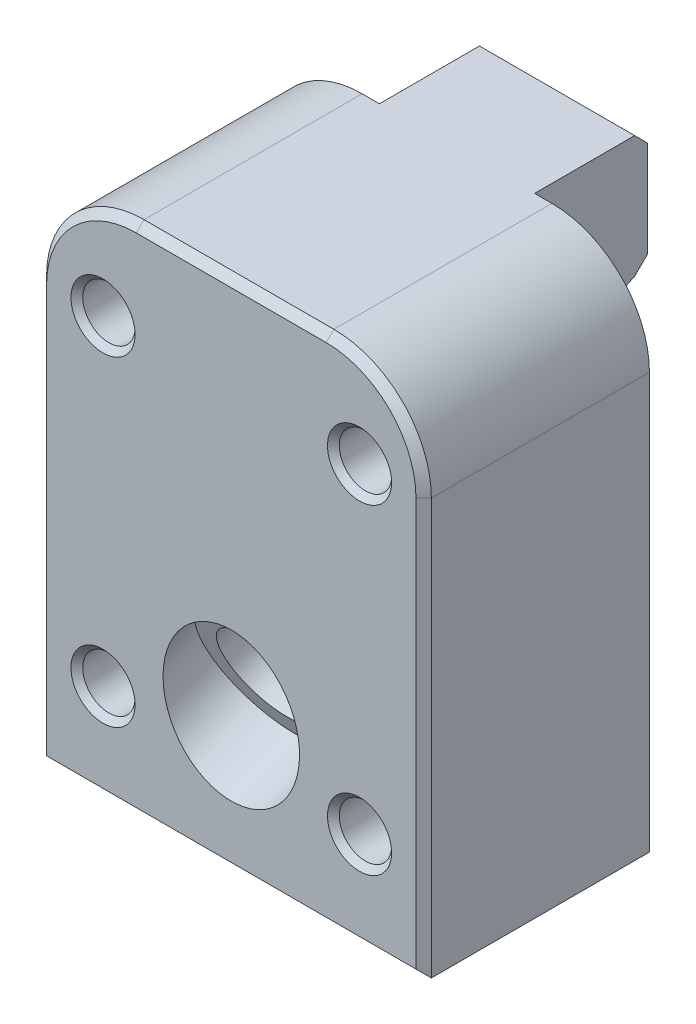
ISO-10303-21;
HEADER;
FILE_DESCRIPTION(('STEP AP214'),'2;1');
FILE_NAME('part.step','',(''),(''),'','','');
FILE_SCHEMA(('AUTOMOTIVE_DESIGN { 1 0 10303 214 1 1 1 1 }'));
ENDSEC;
DATA;
#1=APPLICATION_CONTEXT('core data for automotive mechanical design processes');
#2=APPLICATION_PROTOCOL_DEFINITION('international standard','automotive_design',2000,#1);
#3=PRODUCT_CONTEXT('',#1,'mechanical');
#4=PRODUCT('Part','Part','',(#3));
#5=PRODUCT_RELATED_PRODUCT_CATEGORY('part','',(#4));
#6=PRODUCT_DEFINITION_FORMATION('','',#4);
#7=PRODUCT_DEFINITION_CONTEXT('part definition',#1,'design');
#8=PRODUCT_DEFINITION('design','',#6,#7);
#9=PRODUCT_DEFINITION_SHAPE('','',#8);
#10=(LENGTH_UNIT() NAMED_UNIT(*) SI_UNIT(.MILLI.,.METRE.));
#11=(NAMED_UNIT(*) PLANE_ANGLE_UNIT() SI_UNIT($,.RADIAN.));
#12=(NAMED_UNIT(*) SI_UNIT($,.STERADIAN.) SOLID_ANGLE_UNIT());
#13=UNCERTAINTY_MEASURE_WITH_UNIT(LENGTH_MEASURE(1.E-05),#10,'distance_accuracy_value','');
#14=(GEOMETRIC_REPRESENTATION_CONTEXT(3) GLOBAL_UNCERTAINTY_ASSIGNED_CONTEXT((#13)) GLOBAL_UNIT_ASSIGNED_CONTEXT((#10,
#11,#12)) REPRESENTATION_CONTEXT('',''));
#15=CARTESIAN_POINT('',(0.,0.,0.));
#16=DIRECTION('',(0.,0.,1.));
#17=DIRECTION('',(1.,0.,0.));
#18=AXIS2_PLACEMENT_3D('',#15,#16,#17);
#19=CARTESIAN_POINT('',(0.,50.8,22.352));
#20=DIRECTION('',(0.,0.,-1.));
#21=DIRECTION('',(-1.,0.,0.));
#22=AXIS2_PLACEMENT_3D('',#19,#20,#21);
#23=PLANE('',#22);
#24=DIRECTION('',(0.999999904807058,-0.000436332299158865,0.));
#25=VECTOR('',#24,1.);
#26=CARTESIAN_POINT('',(-9.52500030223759,41.2736146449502,22.352));
#27=LINE('',#26,#25);
#28=CARTESIAN_POINT('',(-9.52474630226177,41.2736145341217,22.352));
#29=VERTEX_POINT('',#28);
#30=CARTESIAN_POINT('',(-9.52500030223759,41.2736146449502,22.352));
#31=VERTEX_POINT('',#30);
#32=EDGE_CURVE('E1412',#29,#31,#27,.F.);
#33=ORIENTED_EDGE('',*,*,#32,.F.);
#34=CARTESIAN_POINT('',(-12.7,41.275,22.352));
#35=DIRECTION('',(0.,0.,1.));
#36=DIRECTION('',(1.,0.,0.));
#37=AXIS2_PLACEMENT_3D('',#34,#35,#36);
#38=CIRCLE('',#37,3.175254);
#39=CARTESIAN_POINT('',(-9.524746,41.275,22.352));
#40=VERTEX_POINT('',#39);
#41=EDGE_CURVE('E1363',#40,#29,#38,.T.);
#42=ORIENTED_EDGE('',*,*,#41,.F.);
#43=DIRECTION('',(1.,0.,0.));
#44=VECTOR('',#43,1.);
#45=CARTESIAN_POINT('',(-9.525,41.275,22.352));
#46=LINE('',#45,#44);
#47=CARTESIAN_POINT('',(-9.525,41.275,22.352));
#48=VERTEX_POINT('',#47);
#49=EDGE_CURVE('E40',#40,#48,#46,.F.);
#50=ORIENTED_EDGE('',*,*,#49,.T.);
#51=CARTESIAN_POINT('',(-12.7,41.275,22.352));
#52=DIRECTION('',(0.,0.,-1.));
#53=DIRECTION('',(-1.,0.,0.));
#54=AXIS2_PLACEMENT_3D('',#51,#52,#53);
#55=CIRCLE('',#54,3.175);
#56=EDGE_CURVE('E412',#48,#31,#55,.T.);
#57=ORIENTED_EDGE('',*,*,#56,.T.);
#58=EDGE_LOOP('',(#33,#42,#50,#57));
#59=FACE_BOUND('',#58,.T.);
#60=DIRECTION('',(0.999999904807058,-0.000436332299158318,0.));
#61=VECTOR('',#60,1.);
#62=CARTESIAN_POINT('',(-9.52500030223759,9.52361464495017,22.352));
#63=LINE('',#62,#61);
#64=CARTESIAN_POINT('',(-9.52474630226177,9.52361453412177,22.352));
#65=VERTEX_POINT('',#64);
#66=CARTESIAN_POINT('',(-9.52500030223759,9.52361464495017,22.352));
#67=VERTEX_POINT('',#66);
#68=EDGE_CURVE('E427',#65,#67,#63,.F.);
#69=ORIENTED_EDGE('',*,*,#68,.F.);
#70=CARTESIAN_POINT('',(-12.7,9.525,22.352));
#71=DIRECTION('',(0.,0.,1.));
#72=DIRECTION('',(1.,0.,0.));
#73=AXIS2_PLACEMENT_3D('',#70,#71,#72);
#74=CIRCLE('',#73,3.175254);
#75=CARTESIAN_POINT('',(-9.524746,9.525,22.352));
#76=VERTEX_POINT('',#75);
#77=EDGE_CURVE('E1519',#76,#65,#74,.T.);
#78=ORIENTED_EDGE('',*,*,#77,.F.);
#79=DIRECTION('',(1.,0.,0.));
#80=VECTOR('',#79,1.);
#81=CARTESIAN_POINT('',(-9.525,9.525,22.352));
#82=LINE('',#81,#80);
#83=CARTESIAN_POINT('',(-9.525,9.525,22.352));
#84=VERTEX_POINT('',#83);
#85=EDGE_CURVE('E430',#76,#84,#82,.F.);
#86=ORIENTED_EDGE('',*,*,#85,.T.);
#87=CARTESIAN_POINT('',(-12.7,9.525,22.352));
#88=DIRECTION('',(0.,0.,-1.));
#89=DIRECTION('',(-1.,0.,0.));
#90=AXIS2_PLACEMENT_3D('',#87,#88,#89);
#91=CIRCLE('',#90,3.175);
#92=EDGE_CURVE('E403',#84,#67,#91,.T.);
#93=ORIENTED_EDGE('',*,*,#92,.T.);
#94=EDGE_LOOP('',(#69,#78,#86,#93));
#95=FACE_BOUND('',#94,.T.);
#96=CARTESIAN_POINT('',(-9.398,41.148,22.352));
#97=DIRECTION('',(0.,0.,-1.));
#98=DIRECTION('',(-1.,0.,0.));
#99=AXIS2_PLACEMENT_3D('',#96,#97,#98);
#100=CIRCLE('',#99,8.89);
#101=CARTESIAN_POINT('',(-9.398,50.038,22.352));
#102=VERTEX_POINT('',#101);
#103=CARTESIAN_POINT('',(-18.288,41.148,22.352));
#104=VERTEX_POINT('',#103);
#105=EDGE_CURVE('E516',#102,#104,#100,.F.);
#106=ORIENTED_EDGE('',*,*,#105,.T.);
#107=DIRECTION('',(0.,-1.,0.));
#108=VECTOR('',#107,1.);
#109=CARTESIAN_POINT('',(-18.288,0.,22.352));
#110=LINE('',#109,#108);
#111=CARTESIAN_POINT('',(-18.288,0.762,22.352));
#112=VERTEX_POINT('',#111);
#113=EDGE_CURVE('E518',#104,#112,#110,.T.);
#114=ORIENTED_EDGE('',*,*,#113,.T.);
#115=DIRECTION('',(1.,0.,0.));
#116=VECTOR('',#115,1.);
#117=CARTESIAN_POINT('',(19.05,0.762,22.352));
#118=LINE('',#117,#116);
#119=CARTESIAN_POINT('',(18.288,0.762,22.352));
#120=VERTEX_POINT('',#119);
#121=EDGE_CURVE('E508',#112,#120,#118,.T.);
#122=ORIENTED_EDGE('',*,*,#121,.T.);
#123=DIRECTION('',(0.,1.,0.));
#124=VECTOR('',#123,1.);
#125=CARTESIAN_POINT('',(18.288,50.8,22.352));
#126=LINE('',#125,#124);
#127=CARTESIAN_POINT('',(18.288,41.148,22.352));
#128=VERTEX_POINT('',#127);
#129=EDGE_CURVE('E510',#120,#128,#126,.T.);
#130=ORIENTED_EDGE('',*,*,#129,.T.);
#131=CARTESIAN_POINT('',(9.398,41.148,22.352));
#132=DIRECTION('',(0.,0.,-1.));
#133=DIRECTION('',(-1.,0.,0.));
#134=AXIS2_PLACEMENT_3D('',#131,#132,#133);
#135=CIRCLE('',#134,8.89);
#136=CARTESIAN_POINT('',(9.398,50.038,22.352));
#137=VERTEX_POINT('',#136);
#138=EDGE_CURVE('E512',#128,#137,#135,.F.);
#139=ORIENTED_EDGE('',*,*,#138,.T.);
#140=DIRECTION('',(-1.,0.,0.));
#141=VECTOR('',#140,1.);
#142=CARTESIAN_POINT('',(0.,50.038,22.352));
#143=LINE('',#142,#141);
#144=EDGE_CURVE('E514',#137,#102,#143,.T.);
#145=ORIENTED_EDGE('',*,*,#144,.T.);
#146=EDGE_LOOP('',(#106,#114,#122,#130,#139,#145));
#147=FACE_BOUND('',#146,.T.);
#148=CARTESIAN_POINT('',(0.,13.3608182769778,22.352));
#149=DIRECTION('',(0.,0.,-1.));
#150=DIRECTION('',(0.,1.,0.));
#151=AXIS2_PLACEMENT_3D('',#148,#149,#150);
#152=ELLIPSE('',#151,7.33988525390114,6.7564);
#153=CARTESIAN_POINT('',(0.,20.7007035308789,22.352));
#154=VERTEX_POINT('',#153);
#155=EDGE_CURVE('E354',#154,#154,#152,.F.);
#156=ORIENTED_EDGE('',*,*,#155,.F.);
#157=EDGE_LOOP('',(#156));
#158=FACE_BOUND('',#157,.T.);
#159=DIRECTION('',(0.999999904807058,-0.000436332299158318,0.));
#160=VECTOR('',#159,1.);
#161=CARTESIAN_POINT('',(15.8749996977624,9.52361464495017,22.352));
#162=LINE('',#161,#160);
#163=CARTESIAN_POINT('',(15.8752536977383,9.52361453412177,22.352));
#164=VERTEX_POINT('',#163);
#165=CARTESIAN_POINT('',(15.8749996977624,9.52361464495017,22.352));
#166=VERTEX_POINT('',#165);
#167=EDGE_CURVE('E1542',#164,#166,#162,.F.);
#168=ORIENTED_EDGE('',*,*,#167,.F.);
#169=CARTESIAN_POINT('',(12.7,9.525,22.352));
#170=DIRECTION('',(0.,0.,1.));
#171=DIRECTION('',(1.,0.,0.));
#172=AXIS2_PLACEMENT_3D('',#169,#170,#171);
#173=CIRCLE('',#172,3.175254);
#174=CARTESIAN_POINT('',(15.875254,9.525,22.352));
#175=VERTEX_POINT('',#174);
#176=EDGE_CURVE('E1487',#175,#164,#173,.T.);
#177=ORIENTED_EDGE('',*,*,#176,.F.);
#178=DIRECTION('',(1.,0.,0.));
#179=VECTOR('',#178,1.);
#180=CARTESIAN_POINT('',(15.875,9.525,22.352));
#181=LINE('',#180,#179);
#182=CARTESIAN_POINT('',(15.875,9.525,22.352));
#183=VERTEX_POINT('',#182);
#184=EDGE_CURVE('E1454',#175,#183,#181,.F.);
#185=ORIENTED_EDGE('',*,*,#184,.T.);
#186=CARTESIAN_POINT('',(12.7,9.525,22.352));
#187=DIRECTION('',(0.,0.,-1.));
#188=DIRECTION('',(-1.,0.,0.));
#189=AXIS2_PLACEMENT_3D('',#186,#187,#188);
#190=CIRCLE('',#189,3.175);
#191=EDGE_CURVE('E407',#183,#166,#190,.T.);
#192=ORIENTED_EDGE('',*,*,#191,.T.);
#193=EDGE_LOOP('',(#168,#177,#185,#192));
#194=FACE_BOUND('',#193,.T.);
#195=DIRECTION('',(0.999999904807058,-0.000436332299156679,0.));
#196=VECTOR('',#195,1.);
#197=CARTESIAN_POINT('',(15.8749996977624,41.2736146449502,22.352));
#198=LINE('',#197,#196);
#199=CARTESIAN_POINT('',(15.8752536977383,41.2736145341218,22.352));
#200=VERTEX_POINT('',#199);
#201=CARTESIAN_POINT('',(15.8749996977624,41.2736146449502,22.352));
#202=VERTEX_POINT('',#201);
#203=EDGE_CURVE('E1385',#200,#202,#198,.F.);
#204=ORIENTED_EDGE('',*,*,#203,.F.);
#205=CARTESIAN_POINT('',(12.7,41.275,22.352));
#206=DIRECTION('',(0.,0.,1.));
#207=DIRECTION('',(1.,0.,0.));
#208=AXIS2_PLACEMENT_3D('',#205,#206,#207);
#209=CIRCLE('',#208,3.175254);
#210=CARTESIAN_POINT('',(15.875254,41.275,22.352));
#211=VERTEX_POINT('',#210);
#212=EDGE_CURVE('E1317',#211,#200,#209,.T.);
#213=ORIENTED_EDGE('',*,*,#212,.F.);
#214=DIRECTION('',(1.,0.,0.));
#215=VECTOR('',#214,1.);
#216=CARTESIAN_POINT('',(15.875,41.275,22.352));
#217=LINE('',#216,#215);
#218=CARTESIAN_POINT('',(15.875,41.275,22.352));
#219=VERTEX_POINT('',#218);
#220=EDGE_CURVE('E19',#211,#219,#217,.F.);
#221=ORIENTED_EDGE('',*,*,#220,.T.);
#222=CARTESIAN_POINT('',(12.7,41.275,22.352));
#223=DIRECTION('',(0.,0.,-1.));
#224=DIRECTION('',(-1.,0.,0.));
#225=AXIS2_PLACEMENT_3D('',#222,#223,#224);
#226=CIRCLE('',#225,3.175);
#227=EDGE_CURVE('E1415',#219,#202,#226,.T.);
#228=ORIENTED_EDGE('',*,*,#227,.T.);
#229=EDGE_LOOP('',(#204,#213,#221,#228));
#230=FACE_BOUND('',#229,.T.);
#231=ADVANCED_FACE('F15',(#59,#95,#147,#158,#194,#230),#23,.F.);
#232=CARTESIAN_POINT('',(-7.6835,50.8,0.));
#233=DIRECTION('',(-1.,0.,0.));
#234=DIRECTION('',(0.,0.,1.));
#235=AXIS2_PLACEMENT_3D('',#232,#233,#234);
#236=PLANE('',#235);
#237=DIRECTION('',(0.,-1.,0.));
#238=VECTOR('',#237,1.);
#239=CARTESIAN_POINT('',(-7.6835,50.8,-11.176));
#240=LINE('',#239,#238);
#241=CARTESIAN_POINT('',(-7.6835,49.53,-11.176));
#242=VERTEX_POINT('',#241);
#243=CARTESIAN_POINT('',(-7.6835,40.0068463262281,-11.176));
#244=VERTEX_POINT('',#243);
#245=EDGE_CURVE('E483',#242,#244,#240,.T.);
#246=ORIENTED_EDGE('',*,*,#245,.T.);
#247=DIRECTION('',(0.,0.707106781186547,-0.707106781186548));
#248=VECTOR('',#247,1.);
#249=CARTESIAN_POINT('',(-7.6835,39.815423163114,-10.984576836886));
#250=LINE('',#249,#248);
#251=CARTESIAN_POINT('',(-7.6835,38.7424676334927,-9.9116213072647));
#252=VERTEX_POINT('',#251);
#253=EDGE_CURVE('E379',#244,#252,#250,.F.);
#254=ORIENTED_EDGE('',*,*,#253,.T.);
#255=DIRECTION('',(0.,0.438371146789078,-0.898794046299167));
#256=VECTOR('',#255,1.);
#257=CARTESIAN_POINT('',(-7.6835,37.15432264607,-6.65544153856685));
#258=LINE('',#257,#256);
#259=CARTESIAN_POINT('',(-7.6835,34.8127462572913,-1.85449847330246));
#260=VERTEX_POINT('',#259);
#261=EDGE_CURVE('E464',#260,#252,#258,.T.);
#262=ORIENTED_EDGE('',*,*,#261,.F.);
#263=CARTESIAN_POINT('',(-7.6835,31.8449283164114,-3.302));
#264=DIRECTION('',(-1.,0.,0.));
#265=DIRECTION('',(0.,0.,1.));
#266=AXIS2_PLACEMENT_3D('',#263,#264,#265);
#267=CIRCLE('',#266,3.302);
#268=CARTESIAN_POINT('',(-7.6835,31.8449283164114,0.));
#269=VERTEX_POINT('',#268);
#270=EDGE_CURVE('E393',#260,#269,#267,.F.);
#271=ORIENTED_EDGE('',*,*,#270,.T.);
#272=DIRECTION('',(0.,-1.,0.));
#273=VECTOR('',#272,1.);
#274=CARTESIAN_POINT('',(-7.6835,50.8,0.));
#275=LINE('',#274,#273);
#276=CARTESIAN_POINT('',(-7.6835,50.8,0.));
#277=VERTEX_POINT('',#276);
#278=EDGE_CURVE('E481',#277,#269,#275,.T.);
#279=ORIENTED_EDGE('',*,*,#278,.F.);
#280=DIRECTION('',(0.,0.,1.));
#281=VECTOR('',#280,1.);
#282=CARTESIAN_POINT('',(-7.6835,50.8,0.));
#283=LINE('',#282,#281);
#284=CARTESIAN_POINT('',(-7.6835,50.8,-9.906));
#285=VERTEX_POINT('',#284);
#286=EDGE_CURVE('E450',#285,#277,#283,.T.);
#287=ORIENTED_EDGE('',*,*,#286,.F.);
#288=DIRECTION('',(0.,0.707106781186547,0.707106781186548));
#289=VECTOR('',#288,1.);
#290=CARTESIAN_POINT('',(-7.6835,55.753,-4.953));
#291=LINE('',#290,#289);
#292=EDGE_CURVE('E369',#285,#242,#291,.F.);
#293=ORIENTED_EDGE('',*,*,#292,.T.);
#294=EDGE_LOOP('',(#246,#254,#262,#271,#279,#287,#293));
#295=FACE_BOUND('',#294,.T.);
#296=ADVANCED_FACE('F300',(#295),#236,.T.);
#297=CARTESIAN_POINT('',(7.6835,50.8,0.));
#298=DIRECTION('',(-1.,0.,0.));
#299=DIRECTION('',(0.,0.,1.));
#300=AXIS2_PLACEMENT_3D('',#297,#298,#299);
#301=PLANE('',#300);
#302=DIRECTION('',(0.,-1.,0.));
#303=VECTOR('',#302,1.);
#304=CARTESIAN_POINT('',(7.6835,50.8,0.));
#305=LINE('',#304,#303);
#306=CARTESIAN_POINT('',(7.6835,50.8,0.));
#307=VERTEX_POINT('',#306);
#308=CARTESIAN_POINT('',(7.6835,31.8449283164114,0.));
#309=VERTEX_POINT('',#308);
#310=EDGE_CURVE('E489',#307,#309,#305,.T.);
#311=ORIENTED_EDGE('',*,*,#310,.T.);
#312=CARTESIAN_POINT('',(7.6835,31.8449283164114,-3.302));
#313=DIRECTION('',(-1.,0.,0.));
#314=DIRECTION('',(0.,0.,1.));
#315=AXIS2_PLACEMENT_3D('',#312,#313,#314);
#316=CIRCLE('',#315,3.302);
#317=CARTESIAN_POINT('',(7.6835,34.8127462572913,-1.85449847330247));
#318=VERTEX_POINT('',#317);
#319=EDGE_CURVE('E396',#309,#318,#316,.T.);
#320=ORIENTED_EDGE('',*,*,#319,.T.);
#321=DIRECTION('',(0.,0.438371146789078,-0.898794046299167));
#322=VECTOR('',#321,1.);
#323=CARTESIAN_POINT('',(7.6835,37.15432264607,-6.65544153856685));
#324=LINE('',#323,#322);
#325=CARTESIAN_POINT('',(7.6835,38.7424676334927,-9.9116213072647));
#326=VERTEX_POINT('',#325);
#327=EDGE_CURVE('E358',#318,#326,#324,.T.);
#328=ORIENTED_EDGE('',*,*,#327,.T.);
#329=DIRECTION('',(0.,-0.707106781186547,0.707106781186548));
#330=VECTOR('',#329,1.);
#331=CARTESIAN_POINT('',(7.6835,40.0068463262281,-11.176));
#332=LINE('',#331,#330);
#333=CARTESIAN_POINT('',(7.6835,40.0068463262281,-11.176));
#334=VERTEX_POINT('',#333);
#335=EDGE_CURVE('E385',#326,#334,#332,.F.);
#336=ORIENTED_EDGE('',*,*,#335,.T.);
#337=DIRECTION('',(0.,-1.,0.));
#338=VECTOR('',#337,1.);
#339=CARTESIAN_POINT('',(7.6835,50.8,-11.176));
#340=LINE('',#339,#338);
#341=CARTESIAN_POINT('',(7.6835,49.53,-11.176));
#342=VERTEX_POINT('',#341);
#343=EDGE_CURVE('E486',#342,#334,#340,.T.);
#344=ORIENTED_EDGE('',*,*,#343,.F.);
#345=DIRECTION('',(0.,-0.707106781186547,-0.707106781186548));
#346=VECTOR('',#345,1.);
#347=CARTESIAN_POINT('',(7.6835,50.8,-9.906));
#348=LINE('',#347,#346);
#349=CARTESIAN_POINT('',(7.6835,50.8,-9.906));
#350=VERTEX_POINT('',#349);
#351=EDGE_CURVE('E374',#342,#350,#348,.F.);
#352=ORIENTED_EDGE('',*,*,#351,.T.);
#353=DIRECTION('',(0.,0.,1.));
#354=VECTOR('',#353,1.);
#355=CARTESIAN_POINT('',(7.6835,50.8,0.));
#356=LINE('',#355,#354);
#357=EDGE_CURVE('E364',#350,#307,#356,.T.);
#358=ORIENTED_EDGE('',*,*,#357,.T.);
#359=EDGE_LOOP('',(#311,#320,#328,#336,#344,#352,#358));
#360=FACE_BOUND('',#359,.T.);
#361=ADVANCED_FACE('F306',(#360),#301,.F.);
#362=CARTESIAN_POINT('',(7.6835,50.8,-11.176));
#363=DIRECTION('',(0.,0.,1.));
#364=DIRECTION('',(1.,0.,0.));
#365=AXIS2_PLACEMENT_3D('',#362,#363,#364);
#366=PLANE('',#365);
#367=ORIENTED_EDGE('',*,*,#343,.T.);
#368=DIRECTION('',(-1.,0.,0.));
#369=VECTOR('',#368,1.);
#370=CARTESIAN_POINT('',(7.6835,40.0068463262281,-11.176));
#371=LINE('',#370,#369);
#372=EDGE_CURVE('E376',#334,#244,#371,.T.);
#373=ORIENTED_EDGE('',*,*,#372,.T.);
#374=ORIENTED_EDGE('',*,*,#245,.F.);
#375=DIRECTION('',(1.,0.,0.));
#376=VECTOR('',#375,1.);
#377=CARTESIAN_POINT('',(7.6835,49.53,-11.176));
#378=LINE('',#377,#376);
#379=EDGE_CURVE('E372',#242,#342,#378,.T.);
#380=ORIENTED_EDGE('',*,*,#379,.T.);
#381=EDGE_LOOP('',(#367,#373,#374,#380));
#382=FACE_BOUND('',#381,.T.);
#383=ADVANCED_FACE('F327',(#382),#366,.F.);
#384=CARTESIAN_POINT('',(-19.05,50.8,22.352));
#385=DIRECTION('',(0.,-1.,0.));
#386=DIRECTION('',(0.,0.,-1.));
#387=AXIS2_PLACEMENT_3D('',#384,#385,#386);
#388=PLANE('',#387);
#389=ORIENTED_EDGE('',*,*,#357,.F.);
#390=DIRECTION('',(-1.,0.,0.));
#391=VECTOR('',#390,1.);
#392=CARTESIAN_POINT('',(-19.05,50.8,-9.906));
#393=LINE('',#392,#391);
#394=EDGE_CURVE('E366',#350,#285,#393,.T.);
#395=ORIENTED_EDGE('',*,*,#394,.T.);
#396=ORIENTED_EDGE('',*,*,#286,.T.);
#397=DIRECTION('',(-1.,0.,0.));
#398=VECTOR('',#397,1.);
#399=CARTESIAN_POINT('',(19.05,50.8,0.));
#400=LINE('',#399,#398);
#401=CARTESIAN_POINT('',(-9.398,50.8,0.));
#402=VERTEX_POINT('',#401);
#403=EDGE_CURVE('E474',#277,#402,#400,.T.);
#404=ORIENTED_EDGE('',*,*,#403,.T.);
#405=DIRECTION('',(0.,0.,-1.));
#406=VECTOR('',#405,1.);
#407=CARTESIAN_POINT('',(-9.398,50.8,22.352));
#408=LINE('',#407,#406);
#409=CARTESIAN_POINT('',(-9.398,50.8,21.59));
#410=VERTEX_POINT('',#409);
#411=EDGE_CURVE('E480',#402,#410,#408,.F.);
#412=ORIENTED_EDGE('',*,*,#411,.T.);
#413=DIRECTION('',(1.,0.,0.));
#414=VECTOR('',#413,1.);
#415=CARTESIAN_POINT('',(-19.05,50.8,21.59));
#416=LINE('',#415,#414);
#417=CARTESIAN_POINT('',(9.398,50.8,21.59));
#418=VERTEX_POINT('',#417);
#419=EDGE_CURVE('E526',#410,#418,#416,.T.);
#420=ORIENTED_EDGE('',*,*,#419,.T.);
#421=DIRECTION('',(0.,0.,-1.));
#422=VECTOR('',#421,1.);
#423=CARTESIAN_POINT('',(9.398,50.8,22.352));
#424=LINE('',#423,#422);
#425=CARTESIAN_POINT('',(9.398,50.8,0.));
#426=VERTEX_POINT('',#425);
#427=EDGE_CURVE('E495',#418,#426,#424,.T.);
#428=ORIENTED_EDGE('',*,*,#427,.T.);
#429=EDGE_CURVE('E469',#426,#307,#400,.T.);
#430=ORIENTED_EDGE('',*,*,#429,.T.);
#431=EDGE_LOOP('',(#389,#395,#396,#404,#412,#420,#428,#430));
#432=FACE_BOUND('',#431,.T.);
#433=ADVANCED_FACE('F313',(#432),#388,.F.);
#434=CARTESIAN_POINT('',(-19.05,0.,22.352));
#435=DIRECTION('',(0.,-1.,0.));
#436=DIRECTION('',(0.,0.,-1.));
#437=AXIS2_PLACEMENT_3D('',#434,#435,#436);
#438=PLANE('',#437);
#439=DIRECTION('',(0.,0.,-1.));
#440=VECTOR('',#439,1.);
#441=CARTESIAN_POINT('',(19.05,0.,22.352));
#442=LINE('',#441,#440);
#443=CARTESIAN_POINT('',(19.05,0.,21.59));
#444=VERTEX_POINT('',#443);
#445=CARTESIAN_POINT('',(19.05,0.,0.));
#446=VERTEX_POINT('',#445);
#447=EDGE_CURVE('E467',#444,#446,#442,.T.);
#448=ORIENTED_EDGE('',*,*,#447,.F.);
#449=DIRECTION('',(-1.,0.,0.));
#450=VECTOR('',#449,1.);
#451=CARTESIAN_POINT('',(-19.05,0.,21.59));
#452=LINE('',#451,#450);
#453=CARTESIAN_POINT('',(-19.05,0.,21.59));
#454=VERTEX_POINT('',#453);
#455=EDGE_CURVE('E370',#444,#454,#452,.T.);
#456=ORIENTED_EDGE('',*,*,#455,.T.);
#457=DIRECTION('',(0.,0.,-1.));
#458=VECTOR('',#457,1.);
#459=CARTESIAN_POINT('',(-19.05,0.,22.352));
#460=LINE('',#459,#458);
#461=CARTESIAN_POINT('',(-19.05,0.,0.));
#462=VERTEX_POINT('',#461);
#463=EDGE_CURVE('E466',#454,#462,#460,.T.);
#464=ORIENTED_EDGE('',*,*,#463,.T.);
#465=DIRECTION('',(-1.,0.,0.));
#466=VECTOR('',#465,1.);
#467=CARTESIAN_POINT('',(19.05,0.,0.));
#468=LINE('',#467,#466);
#469=EDGE_CURVE('E470',#446,#462,#468,.T.);
#470=ORIENTED_EDGE('',*,*,#469,.F.);
#471=EDGE_LOOP('',(#448,#456,#464,#470));
#472=FACE_BOUND('',#471,.T.);
#473=ADVANCED_FACE('F333',(#472),#438,.T.);
#474=CARTESIAN_POINT('',(-19.05,50.8,22.352));
#475=DIRECTION('',(-1.,0.,0.));
#476=DIRECTION('',(0.,0.,1.));
#477=AXIS2_PLACEMENT_3D('',#474,#475,#476);
#478=PLANE('',#477);
#479=ORIENTED_EDGE('',*,*,#463,.F.);
#480=DIRECTION('',(0.,1.,0.));
#481=VECTOR('',#480,1.);
#482=CARTESIAN_POINT('',(-19.05,41.148,21.59));
#483=LINE('',#482,#481);
#484=CARTESIAN_POINT('',(-19.05,41.148,21.59));
#485=VERTEX_POINT('',#484);
#486=EDGE_CURVE('E521',#454,#485,#483,.T.);
#487=ORIENTED_EDGE('',*,*,#486,.T.);
#488=DIRECTION('',(0.,0.,-1.));
#489=VECTOR('',#488,1.);
#490=CARTESIAN_POINT('',(-19.05,41.148,22.352));
#491=LINE('',#490,#489);
#492=CARTESIAN_POINT('',(-19.05,41.148,0.));
#493=VERTEX_POINT('',#492);
#494=EDGE_CURVE('E506',#485,#493,#491,.T.);
#495=ORIENTED_EDGE('',*,*,#494,.T.);
#496=DIRECTION('',(0.,-1.,0.));
#497=VECTOR('',#496,1.);
#498=CARTESIAN_POINT('',(-19.05,50.8,0.));
#499=LINE('',#498,#497);
#500=EDGE_CURVE('E477',#493,#462,#499,.T.);
#501=ORIENTED_EDGE('',*,*,#500,.T.);
#502=EDGE_LOOP('',(#479,#487,#495,#501));
#503=FACE_BOUND('',#502,.T.);
#504=ADVANCED_FACE('F323',(#503),#478,.T.);
#505=CARTESIAN_POINT('',(19.05,50.8,0.));
#506=DIRECTION('',(0.,0.,1.));
#507=DIRECTION('',(1.,0.,0.));
#508=AXIS2_PLACEMENT_3D('',#505,#506,#507);
#509=PLANE('',#508);
#510=ORIENTED_EDGE('',*,*,#278,.T.);
#511=DIRECTION('',(-1.,0.,0.));
#512=VECTOR('',#511,1.);
#513=CARTESIAN_POINT('',(7.6835,31.8449283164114,0.));
#514=LINE('',#513,#512);
#515=EDGE_CURVE('E390',#269,#309,#514,.F.);
#516=ORIENTED_EDGE('',*,*,#515,.T.);
#517=ORIENTED_EDGE('',*,*,#310,.F.);
#518=ORIENTED_EDGE('',*,*,#429,.F.);
#519=CARTESIAN_POINT('',(9.398,41.148,0.));
#520=DIRECTION('',(0.,0.,1.));
#521=DIRECTION('',(1.,0.,0.));
#522=AXIS2_PLACEMENT_3D('',#519,#520,#521);
#523=CIRCLE('',#522,9.652);
#524=CARTESIAN_POINT('',(19.05,41.148,0.));
#525=VERTEX_POINT('',#524);
#526=EDGE_CURVE('E501',#426,#525,#523,.F.);
#527=ORIENTED_EDGE('',*,*,#526,.T.);
#528=DIRECTION('',(0.,-1.,0.));
#529=VECTOR('',#528,1.);
#530=CARTESIAN_POINT('',(19.05,50.8,0.));
#531=LINE('',#530,#529);
#532=EDGE_CURVE('E476',#525,#446,#531,.T.);
#533=ORIENTED_EDGE('',*,*,#532,.T.);
#534=ORIENTED_EDGE('',*,*,#469,.T.);
#535=ORIENTED_EDGE('',*,*,#500,.F.);
#536=CARTESIAN_POINT('',(-9.398,41.148,0.));
#537=DIRECTION('',(0.,0.,1.));
#538=DIRECTION('',(1.,0.,0.));
#539=AXIS2_PLACEMENT_3D('',#536,#537,#538);
#540=CIRCLE('',#539,9.652);
#541=EDGE_CURVE('E498',#493,#402,#540,.F.);
#542=ORIENTED_EDGE('',*,*,#541,.T.);
#543=ORIENTED_EDGE('',*,*,#403,.F.);
#544=EDGE_LOOP('',(#510,#516,#517,#518,#527,#533,#534,#535,#542,#543));
#545=FACE_BOUND('',#544,.T.);
#546=CARTESIAN_POINT('',(0.,22.8486793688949,0.));
#547=DIRECTION('',(0.,0.,1.));
#548=DIRECTION('',(0.,-1.,0.));
#549=AXIS2_PLACEMENT_3D('',#546,#547,#548);
#550=ELLIPSE('',#549,5.18068968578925,4.76885);
#551=CARTESIAN_POINT('',(0.,17.6679896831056,0.));
#552=VERTEX_POINT('',#551);
#553=EDGE_CURVE('E355',#552,#552,#550,.T.);
#554=ORIENTED_EDGE('',*,*,#553,.T.);
#555=EDGE_LOOP('',(#554));
#556=FACE_BOUND('',#555,.T.);
#557=ADVANCED_FACE('F319',(#545,#556),#509,.F.);
#558=CARTESIAN_POINT('',(19.05,50.8,22.352));
#559=DIRECTION('',(-1.,0.,0.));
#560=DIRECTION('',(0.,0.,1.));
#561=AXIS2_PLACEMENT_3D('',#558,#559,#560);
#562=PLANE('',#561);
#563=DIRECTION('',(0.,0.,-1.));
#564=VECTOR('',#563,1.);
#565=CARTESIAN_POINT('',(19.05,41.148,22.352));
#566=LINE('',#565,#564);
#567=CARTESIAN_POINT('',(19.05,41.148,21.59));
#568=VERTEX_POINT('',#567);
#569=EDGE_CURVE('E503',#525,#568,#566,.F.);
#570=ORIENTED_EDGE('',*,*,#569,.T.);
#571=DIRECTION('',(0.,-1.,0.));
#572=VECTOR('',#571,1.);
#573=CARTESIAN_POINT('',(19.05,50.8,21.59));
#574=LINE('',#573,#572);
#575=EDGE_CURVE('E530',#568,#444,#574,.T.);
#576=ORIENTED_EDGE('',*,*,#575,.T.);
#577=ORIENTED_EDGE('',*,*,#447,.T.);
#578=ORIENTED_EDGE('',*,*,#532,.F.);
#579=EDGE_LOOP('',(#570,#576,#577,#578));
#580=FACE_BOUND('',#579,.T.);
#581=ADVANCED_FACE('F315',(#580),#562,.F.);
#582=CARTESIAN_POINT('',(134.20989485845,33.908246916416,0.));
#583=DIRECTION('',(0.,0.898794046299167,0.438371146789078));
#584=DIRECTION('',(0.,-0.438371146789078,0.898794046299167));
#585=AXIS2_PLACEMENT_3D('',#582,#583,#584);
#586=PLANE('',#585);
#587=ORIENTED_EDGE('',*,*,#327,.F.);
#588=DIRECTION('',(-1.,0.,0.));
#589=VECTOR('',#588,1.);
#590=CARTESIAN_POINT('',(-7.6835,34.8127462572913,-1.85449847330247));
#591=LINE('',#590,#589);
#592=EDGE_CURVE('E387',#318,#260,#591,.T.);
#593=ORIENTED_EDGE('',*,*,#592,.T.);
#594=ORIENTED_EDGE('',*,*,#261,.T.);
#595=DIRECTION('',(1.,0.,0.));
#596=VECTOR('',#595,1.);
#597=CARTESIAN_POINT('',(134.20989485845,38.7424676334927,-9.9116213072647));
#598=LINE('',#597,#596);
#599=EDGE_CURVE('E382',#252,#326,#598,.T.);
#600=ORIENTED_EDGE('',*,*,#599,.T.);
#601=EDGE_LOOP('',(#587,#593,#594,#600));
#602=FACE_BOUND('',#601,.T.);
#603=ADVANCED_FACE('F318',(#602),#586,.F.);
#604=CARTESIAN_POINT('',(0.,4.97827460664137,42.1000353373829));
#605=DIRECTION('',(0.,0.390731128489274,-0.92050485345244));
#606=DIRECTION('',(0.,0.92050485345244,0.390731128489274));
#607=AXIS2_PLACEMENT_3D('',#604,#605,#606);
#608=CYLINDRICAL_SURFACE('',#607,6.7564);
#609=CARTESIAN_POINT('',(0.,14.9032422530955,18.7182768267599));
#610=DIRECTION('',(0.,-0.390731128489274,0.920504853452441));
#611=DIRECTION('',(0.,-0.92050485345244,-0.390731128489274));
#612=AXIS2_PLACEMENT_3D('',#609,#610,#611);
#613=CIRCLE('',#612,6.7564);
#614=CARTESIAN_POINT('',(0.,8.68394326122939,16.0783410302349));
#615=VERTEX_POINT('',#614);
#616=EDGE_CURVE('E353',#615,#615,#613,.T.);
#617=ORIENTED_EDGE('',*,*,#616,.F.);
#618=EDGE_LOOP('',(#617));
#619=FACE_BOUND('',#618,.T.);
#620=ORIENTED_EDGE('',*,*,#155,.T.);
#621=EDGE_LOOP('',(#620));
#622=FACE_BOUND('',#621,.T.);
#623=ADVANCED_FACE('F337',(#619,#622),#608,.F.);
#624=CARTESIAN_POINT('',(0.,14.9032422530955,18.7182768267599));
#625=DIRECTION('',(0.,-0.390731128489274,0.920504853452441));
#626=DIRECTION('',(0.,-0.92050485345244,-0.390731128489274));
#627=AXIS2_PLACEMENT_3D('',#624,#625,#626);
#628=PLANE('',#627);
#629=CARTESIAN_POINT('',(0.,14.9032422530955,18.7182768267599));
#630=DIRECTION('',(0.,-0.390731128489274,0.920504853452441));
#631=DIRECTION('',(0.,-0.92050485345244,-0.390731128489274));
#632=AXIS2_PLACEMENT_3D('',#629,#630,#631);
#633=CIRCLE('',#632,4.76885);
#634=CARTESIAN_POINT('',(0.,10.5134926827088,16.8549386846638));
#635=VERTEX_POINT('',#634);
#636=EDGE_CURVE('E350',#635,#635,#633,.T.);
#637=ORIENTED_EDGE('',*,*,#636,.F.);
#638=EDGE_LOOP('',(#637));
#639=FACE_BOUND('',#638,.T.);
#640=ORIENTED_EDGE('',*,*,#616,.T.);
#641=EDGE_LOOP('',(#640));
#642=FACE_BOUND('',#641,.T.);
#643=ADVANCED_FACE('F335',(#639,#642),#628,.T.);
#644=CARTESIAN_POINT('',(0.,24.8274159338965,-4.66161121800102));
#645=DIRECTION('',(0.,-0.390731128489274,0.92050485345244));
#646=DIRECTION('',(0.,-0.92050485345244,-0.390731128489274));
#647=AXIS2_PLACEMENT_3D('',#644,#645,#646);
#648=CYLINDRICAL_SURFACE('',#647,4.76885);
#649=ORIENTED_EDGE('',*,*,#636,.T.);
#650=EDGE_LOOP('',(#649));
#651=FACE_BOUND('',#650,.T.);
#652=ORIENTED_EDGE('',*,*,#553,.F.);
#653=EDGE_LOOP('',(#652));
#654=FACE_BOUND('',#653,.T.);
#655=ADVANCED_FACE('F17',(#651,#654),#648,.F.);
#656=CARTESIAN_POINT('',(-12.7,9.525,9.398));
#657=DIRECTION('',(0.,0.,1.));
#658=DIRECTION('',(1.,0.,0.));
#659=AXIS2_PLACEMENT_3D('',#656,#657,#658);
#660=CYLINDRICAL_SURFACE('',#659,2.5908);
#661=CARTESIAN_POINT('',(-12.7,9.525,21.7678));
#662=DIRECTION('',(0.,0.,-1.));
#663=DIRECTION('',(-1.,0.,0.));
#664=AXIS2_PLACEMENT_3D('',#661,#662,#663);
#665=CIRCLE('',#664,2.5908);
#666=CARTESIAN_POINT('',(-15.2908,9.525,21.7678));
#667=VERTEX_POINT('',#666);
#668=EDGE_CURVE('E9',#667,#667,#665,.F.);
#669=ORIENTED_EDGE('',*,*,#668,.T.);
#670=EDGE_LOOP('',(#669));
#671=FACE_BOUND('',#670,.T.);
#672=CARTESIAN_POINT('',(-12.7,9.525,8.128));
#673=DIRECTION('',(0.,0.,-1.));
#674=DIRECTION('',(-1.,0.,0.));
#675=AXIS2_PLACEMENT_3D('',#672,#673,#674);
#676=CIRCLE('',#675,2.5908);
#677=CARTESIAN_POINT('',(-15.2908,9.525,8.128));
#678=VERTEX_POINT('',#677);
#679=EDGE_CURVE('E1302',#678,#678,#676,.T.);
#680=ORIENTED_EDGE('',*,*,#679,.T.);
#681=EDGE_LOOP('',(#680));
#682=FACE_BOUND('',#681,.T.);
#683=ADVANCED_FACE('F343',(#671,#682),#660,.F.);
#684=CARTESIAN_POINT('',(12.7,41.275,9.398));
#685=DIRECTION('',(0.,0.,1.));
#686=DIRECTION('',(1.,0.,0.));
#687=AXIS2_PLACEMENT_3D('',#684,#685,#686);
#688=CYLINDRICAL_SURFACE('',#687,2.5908);
#689=CARTESIAN_POINT('',(12.7,41.275,21.7678));
#690=DIRECTION('',(0.,0.,-1.));
#691=DIRECTION('',(-1.,0.,0.));
#692=AXIS2_PLACEMENT_3D('',#689,#690,#691);
#693=CIRCLE('',#692,2.5908);
#694=CARTESIAN_POINT('',(10.1092,41.275,21.7678));
#695=VERTEX_POINT('',#694);
#696=EDGE_CURVE('E404',#695,#695,#693,.F.);
#697=ORIENTED_EDGE('',*,*,#696,.T.);
#698=EDGE_LOOP('',(#697));
#699=FACE_BOUND('',#698,.T.);
#700=CARTESIAN_POINT('',(12.7,41.275,8.128));
#701=DIRECTION('',(0.,0.,-1.));
#702=DIRECTION('',(-1.,0.,0.));
#703=AXIS2_PLACEMENT_3D('',#700,#701,#702);
#704=CIRCLE('',#703,2.5908);
#705=CARTESIAN_POINT('',(10.1092,41.275,8.128));
#706=VERTEX_POINT('',#705);
#707=EDGE_CURVE('E1299',#706,#706,#704,.T.);
#708=ORIENTED_EDGE('',*,*,#707,.T.);
#709=EDGE_LOOP('',(#708));
#710=FACE_BOUND('',#709,.T.);
#711=ADVANCED_FACE('F617',(#699,#710),#688,.F.);
#712=CARTESIAN_POINT('',(-12.7,41.275,9.398));
#713=DIRECTION('',(0.,0.,1.));
#714=DIRECTION('',(1.,0.,0.));
#715=AXIS2_PLACEMENT_3D('',#712,#713,#714);
#716=CYLINDRICAL_SURFACE('',#715,2.5908);
#717=CARTESIAN_POINT('',(-12.7,41.275,21.7678));
#718=DIRECTION('',(0.,0.,-1.));
#719=DIRECTION('',(-1.,0.,0.));
#720=AXIS2_PLACEMENT_3D('',#717,#718,#719);
#721=CIRCLE('',#720,2.5908);
#722=CARTESIAN_POINT('',(-15.2908,41.275,21.7678));
#723=VERTEX_POINT('',#722);
#724=EDGE_CURVE('E25',#723,#723,#721,.F.);
#725=ORIENTED_EDGE('',*,*,#724,.T.);
#726=EDGE_LOOP('',(#725));
#727=FACE_BOUND('',#726,.T.);
#728=CARTESIAN_POINT('',(-12.7,41.275,8.128));
#729=DIRECTION('',(0.,0.,-1.));
#730=DIRECTION('',(-1.,0.,0.));
#731=AXIS2_PLACEMENT_3D('',#728,#729,#730);
#732=CIRCLE('',#731,2.5908);
#733=CARTESIAN_POINT('',(-15.2908,41.275,8.128));
#734=VERTEX_POINT('',#733);
#735=EDGE_CURVE('E1301',#734,#734,#732,.T.);
#736=ORIENTED_EDGE('',*,*,#735,.T.);
#737=EDGE_LOOP('',(#736));
#738=FACE_BOUND('',#737,.T.);
#739=ADVANCED_FACE('F613',(#727,#738),#716,.F.);
#740=CARTESIAN_POINT('',(12.7,9.525,9.398));
#741=DIRECTION('',(0.,0.,1.));
#742=DIRECTION('',(1.,0.,0.));
#743=AXIS2_PLACEMENT_3D('',#740,#741,#742);
#744=CYLINDRICAL_SURFACE('',#743,2.5908);
#745=CARTESIAN_POINT('',(12.7,9.525,21.7678));
#746=DIRECTION('',(0.,0.,-1.));
#747=DIRECTION('',(-1.,0.,0.));
#748=AXIS2_PLACEMENT_3D('',#745,#746,#747);
#749=CIRCLE('',#748,2.5908);
#750=CARTESIAN_POINT('',(10.1092,9.525,21.7678));
#751=VERTEX_POINT('',#750);
#752=EDGE_CURVE('E398',#751,#751,#749,.F.);
#753=ORIENTED_EDGE('',*,*,#752,.T.);
#754=EDGE_LOOP('',(#753));
#755=FACE_BOUND('',#754,.T.);
#756=CARTESIAN_POINT('',(12.7,9.525,8.128));
#757=DIRECTION('',(0.,0.,-1.));
#758=DIRECTION('',(-1.,0.,0.));
#759=AXIS2_PLACEMENT_3D('',#756,#757,#758);
#760=CIRCLE('',#759,2.5908);
#761=CARTESIAN_POINT('',(10.1092,9.525,8.128));
#762=VERTEX_POINT('',#761);
#763=EDGE_CURVE('E1308',#762,#762,#760,.T.);
#764=ORIENTED_EDGE('',*,*,#763,.T.);
#765=EDGE_LOOP('',(#764));
#766=FACE_BOUND('',#765,.T.);
#767=ADVANCED_FACE('F607',(#755,#766),#744,.F.);
#768=CARTESIAN_POINT('',(9.398,41.148,22.352));
#769=DIRECTION('',(0.,0.,-1.));
#770=DIRECTION('',(-1.,0.,0.));
#771=AXIS2_PLACEMENT_3D('',#768,#769,#770);
#772=CYLINDRICAL_SURFACE('',#771,9.652);
#773=ORIENTED_EDGE('',*,*,#427,.F.);
#774=CARTESIAN_POINT('',(9.398,41.148,21.59));
#775=DIRECTION('',(0.,0.,-1.));
#776=DIRECTION('',(-1.,0.,0.));
#777=AXIS2_PLACEMENT_3D('',#774,#775,#776);
#778=CIRCLE('',#777,9.652);
#779=EDGE_CURVE('E528',#418,#568,#778,.T.);
#780=ORIENTED_EDGE('',*,*,#779,.T.);
#781=ORIENTED_EDGE('',*,*,#569,.F.);
#782=ORIENTED_EDGE('',*,*,#526,.F.);
#783=EDGE_LOOP('',(#773,#780,#781,#782));
#784=FACE_BOUND('',#783,.T.);
#785=ADVANCED_FACE('F589',(#784),#772,.T.);
#786=CARTESIAN_POINT('',(-9.398,41.148,22.352));
#787=DIRECTION('',(0.,0.,1.));
#788=DIRECTION('',(1.,0.,0.));
#789=AXIS2_PLACEMENT_3D('',#786,#787,#788);
#790=CYLINDRICAL_SURFACE('',#789,9.652);
#791=ORIENTED_EDGE('',*,*,#494,.F.);
#792=CARTESIAN_POINT('',(-9.398,41.148,21.59));
#793=DIRECTION('',(0.,0.,-1.));
#794=DIRECTION('',(-1.,0.,0.));
#795=AXIS2_PLACEMENT_3D('',#792,#793,#794);
#796=CIRCLE('',#795,9.652);
#797=EDGE_CURVE('E524',#485,#410,#796,.T.);
#798=ORIENTED_EDGE('',*,*,#797,.T.);
#799=ORIENTED_EDGE('',*,*,#411,.F.);
#800=ORIENTED_EDGE('',*,*,#541,.F.);
#801=EDGE_LOOP('',(#791,#798,#799,#800));
#802=FACE_BOUND('',#801,.T.);
#803=ADVANCED_FACE('F599',(#802),#790,.T.);
#804=CARTESIAN_POINT('',(9.398,41.148,22.352));
#805=DIRECTION('',(0.,0.,-1.));
#806=DIRECTION('',(-1.,0.,0.));
#807=AXIS2_PLACEMENT_3D('',#804,#805,#806);
#808=CONICAL_SURFACE('',#807,8.89,0.785398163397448);
#809=DIRECTION('',(-0.707106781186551,0.,0.707106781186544));
#810=VECTOR('',#809,1.);
#811=CARTESIAN_POINT('',(19.05,41.148,21.59));
#812=LINE('',#811,#810);
#813=EDGE_CURVE('E458',#568,#128,#812,.T.);
#814=ORIENTED_EDGE('',*,*,#813,.F.);
#815=ORIENTED_EDGE('',*,*,#779,.F.);
#816=DIRECTION('',(0.,0.707106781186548,-0.707106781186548));
#817=VECTOR('',#816,1.);
#818=CARTESIAN_POINT('',(9.398,50.038,22.352));
#819=LINE('',#818,#817);
#820=EDGE_CURVE('E399',#137,#418,#819,.T.);
#821=ORIENTED_EDGE('',*,*,#820,.F.);
#822=ORIENTED_EDGE('',*,*,#138,.F.);
#823=EDGE_LOOP('',(#814,#815,#821,#822));
#824=FACE_BOUND('',#823,.T.);
#825=ADVANCED_FACE('F585',(#824),#808,.T.);
#826=CARTESIAN_POINT('',(-19.05,50.8,21.59));
#827=DIRECTION('',(0.,-0.707106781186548,-0.707106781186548));
#828=DIRECTION('',(0.,0.707106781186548,-0.707106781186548));
#829=AXIS2_PLACEMENT_3D('',#826,#827,#828);
#830=PLANE('',#829);
#831=ORIENTED_EDGE('',*,*,#820,.T.);
#832=ORIENTED_EDGE('',*,*,#419,.F.);
#833=DIRECTION('',(0.,0.707106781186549,-0.707106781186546));
#834=VECTOR('',#833,1.);
#835=CARTESIAN_POINT('',(-9.398,50.038,22.352));
#836=LINE('',#835,#834);
#837=EDGE_CURVE('E455',#102,#410,#836,.T.);
#838=ORIENTED_EDGE('',*,*,#837,.F.);
#839=ORIENTED_EDGE('',*,*,#144,.F.);
#840=EDGE_LOOP('',(#831,#832,#838,#839));
#841=FACE_BOUND('',#840,.T.);
#842=ADVANCED_FACE('F569',(#841),#830,.F.);
#843=CARTESIAN_POINT('',(19.05,50.8,21.59));
#844=DIRECTION('',(-0.707106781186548,0.,-0.707106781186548));
#845=DIRECTION('',(-0.707106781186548,0.,0.707106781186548));
#846=AXIS2_PLACEMENT_3D('',#843,#844,#845);
#847=PLANE('',#846);
#848=ORIENTED_EDGE('',*,*,#813,.T.);
#849=ORIENTED_EDGE('',*,*,#129,.F.);
#850=DIRECTION('',(0.577350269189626,-0.577350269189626,-0.577350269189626));
#851=VECTOR('',#850,1.);
#852=CARTESIAN_POINT('',(12.192,6.858,28.448));
#853=LINE('',#852,#851);
#854=EDGE_CURVE('E452',#444,#120,#853,.F.);
#855=ORIENTED_EDGE('',*,*,#854,.F.);
#856=ORIENTED_EDGE('',*,*,#575,.F.);
#857=EDGE_LOOP('',(#848,#849,#855,#856));
#858=FACE_BOUND('',#857,.T.);
#859=ADVANCED_FACE('F770',(#858),#847,.F.);
#860=CARTESIAN_POINT('',(-9.398,41.148,22.352));
#861=DIRECTION('',(0.,0.,-1.));
#862=DIRECTION('',(-1.,0.,0.));
#863=AXIS2_PLACEMENT_3D('',#860,#861,#862);
#864=CONICAL_SURFACE('',#863,8.89,0.785398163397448);
#865=ORIENTED_EDGE('',*,*,#837,.T.);
#866=ORIENTED_EDGE('',*,*,#797,.F.);
#867=DIRECTION('',(-0.707106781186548,0.,-0.707106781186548));
#868=VECTOR('',#867,1.);
#869=CARTESIAN_POINT('',(-18.288,41.148,22.352));
#870=LINE('',#869,#868);
#871=EDGE_CURVE('E449',#104,#485,#870,.T.);
#872=ORIENTED_EDGE('',*,*,#871,.F.);
#873=ORIENTED_EDGE('',*,*,#105,.F.);
#874=EDGE_LOOP('',(#865,#866,#872,#873));
#875=FACE_BOUND('',#874,.T.);
#876=ADVANCED_FACE('F575',(#875),#864,.T.);
#877=CARTESIAN_POINT('',(0.,0.762,22.352));
#878=DIRECTION('',(0.,-0.707106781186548,0.707106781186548));
#879=DIRECTION('',(0.,-0.707106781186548,-0.707106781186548));
#880=AXIS2_PLACEMENT_3D('',#877,#878,#879);
#881=PLANE('',#880);
#882=ORIENTED_EDGE('',*,*,#854,.T.);
#883=ORIENTED_EDGE('',*,*,#121,.F.);
#884=DIRECTION('',(-0.577350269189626,-0.577350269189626,-0.577350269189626));
#885=VECTOR('',#884,1.);
#886=CARTESIAN_POINT('',(-12.192,6.858,28.448));
#887=LINE('',#886,#885);
#888=EDGE_CURVE('E447',#454,#112,#887,.F.);
#889=ORIENTED_EDGE('',*,*,#888,.F.);
#890=ORIENTED_EDGE('',*,*,#455,.F.);
#891=EDGE_LOOP('',(#882,#883,#889,#890));
#892=FACE_BOUND('',#891,.T.);
#893=ADVANCED_FACE('F787',(#892),#881,.T.);
#894=CARTESIAN_POINT('',(-18.288,50.8,22.352));
#895=DIRECTION('',(-0.707106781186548,0.,0.707106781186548));
#896=DIRECTION('',(0.707106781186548,0.,0.707106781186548));
#897=AXIS2_PLACEMENT_3D('',#894,#895,#896);
#898=PLANE('',#897);
#899=ORIENTED_EDGE('',*,*,#871,.T.);
#900=ORIENTED_EDGE('',*,*,#486,.F.);
#901=ORIENTED_EDGE('',*,*,#888,.T.);
#902=ORIENTED_EDGE('',*,*,#113,.F.);
#903=EDGE_LOOP('',(#899,#900,#901,#902));
#904=FACE_BOUND('',#903,.T.);
#905=ADVANCED_FACE('F796',(#904),#898,.T.);
#906=CARTESIAN_POINT('',(-19.05,50.8,-9.906));
#907=DIRECTION('',(0.,-0.707106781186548,0.707106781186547));
#908=DIRECTION('',(0.,-0.707106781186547,-0.707106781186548));
#909=AXIS2_PLACEMENT_3D('',#906,#907,#908);
#910=PLANE('',#909);
#911=ORIENTED_EDGE('',*,*,#351,.F.);
#912=ORIENTED_EDGE('',*,*,#379,.F.);
#913=ORIENTED_EDGE('',*,*,#292,.F.);
#914=ORIENTED_EDGE('',*,*,#394,.F.);
#915=EDGE_LOOP('',(#911,#912,#913,#914));
#916=FACE_BOUND('',#915,.T.);
#917=ADVANCED_FACE('F561',(#916),#910,.F.);
#918=CARTESIAN_POINT('',(7.6835,40.0068463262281,-11.176));
#919=DIRECTION('',(0.,0.707106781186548,0.707106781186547));
#920=DIRECTION('',(0.,-0.707106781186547,0.707106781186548));
#921=AXIS2_PLACEMENT_3D('',#918,#919,#920);
#922=PLANE('',#921);
#923=ORIENTED_EDGE('',*,*,#335,.F.);
#924=ORIENTED_EDGE('',*,*,#599,.F.);
#925=ORIENTED_EDGE('',*,*,#253,.F.);
#926=ORIENTED_EDGE('',*,*,#372,.F.);
#927=EDGE_LOOP('',(#923,#924,#925,#926));
#928=FACE_BOUND('',#927,.T.);
#929=ADVANCED_FACE('F557',(#928),#922,.F.);
#930=CARTESIAN_POINT('',(134.20989485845,31.8449283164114,-3.302));
#931=DIRECTION('',(1.,0.,0.));
#932=DIRECTION('',(0.,0.,-1.));
#933=AXIS2_PLACEMENT_3D('',#930,#931,#932);
#934=CYLINDRICAL_SURFACE('',#933,3.302);
#935=ORIENTED_EDGE('',*,*,#319,.F.);
#936=ORIENTED_EDGE('',*,*,#515,.F.);
#937=ORIENTED_EDGE('',*,*,#270,.F.);
#938=ORIENTED_EDGE('',*,*,#592,.F.);
#939=EDGE_LOOP('',(#935,#936,#937,#938));
#940=FACE_BOUND('',#939,.T.);
#941=ADVANCED_FACE('F549',(#940),#934,.F.);
#942=CARTESIAN_POINT('',(12.7,9.525,21.7678));
#943=DIRECTION('',(0.,0.,1.));
#944=DIRECTION('',(1.,0.,0.));
#945=AXIS2_PLACEMENT_3D('',#942,#943,#944);
#946=CONICAL_SURFACE('',#945,2.5908,0.785398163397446);
#947=ORIENTED_EDGE('',*,*,#191,.F.);
#948=CARTESIAN_POINT('',(12.7,9.525,22.352));
#949=DIRECTION('',(0.,0.,1.));
#950=DIRECTION('',(1.,0.,0.));
#951=AXIS2_PLACEMENT_3D('',#948,#949,#950);
#952=CIRCLE('',#951,3.175);
#953=EDGE_CURVE('E1585',#183,#166,#952,.T.);
#954=ORIENTED_EDGE('',*,*,#953,.T.);
#955=EDGE_LOOP('',(#947,#954));
#956=FACE_BOUND('',#955,.T.);
#957=ORIENTED_EDGE('',*,*,#752,.F.);
#958=EDGE_LOOP('',(#957));
#959=FACE_BOUND('',#958,.T.);
#960=ADVANCED_FACE('F831',(#956,#959),#946,.F.);
#961=CARTESIAN_POINT('',(12.7,41.275,21.7678));
#962=DIRECTION('',(0.,0.,1.));
#963=DIRECTION('',(1.,0.,0.));
#964=AXIS2_PLACEMENT_3D('',#961,#962,#963);
#965=CONICAL_SURFACE('',#964,2.5908,0.785398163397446);
#966=ORIENTED_EDGE('',*,*,#227,.F.);
#967=CARTESIAN_POINT('',(12.7,41.275,22.352));
#968=DIRECTION('',(0.,0.,1.));
#969=DIRECTION('',(1.,0.,0.));
#970=AXIS2_PLACEMENT_3D('',#967,#968,#969);
#971=CIRCLE('',#970,3.175);
#972=EDGE_CURVE('E1422',#219,#202,#971,.T.);
#973=ORIENTED_EDGE('',*,*,#972,.T.);
#974=EDGE_LOOP('',(#966,#973));
#975=FACE_BOUND('',#974,.T.);
#976=ORIENTED_EDGE('',*,*,#696,.F.);
#977=EDGE_LOOP('',(#976));
#978=FACE_BOUND('',#977,.T.);
#979=ADVANCED_FACE('F840',(#975,#978),#965,.F.);
#980=CARTESIAN_POINT('',(-12.7,41.275,21.7678));
#981=DIRECTION('',(0.,0.,1.));
#982=DIRECTION('',(1.,0.,0.));
#983=AXIS2_PLACEMENT_3D('',#980,#981,#982);
#984=CONICAL_SURFACE('',#983,2.5908,0.785398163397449);
#985=ORIENTED_EDGE('',*,*,#56,.F.);
#986=CARTESIAN_POINT('',(-12.7,41.275,22.352));
#987=DIRECTION('',(0.,0.,1.));
#988=DIRECTION('',(1.,0.,0.));
#989=AXIS2_PLACEMENT_3D('',#986,#987,#988);
#990=CIRCLE('',#989,3.175);
#991=EDGE_CURVE('E1461',#48,#31,#990,.T.);
#992=ORIENTED_EDGE('',*,*,#991,.T.);
#993=EDGE_LOOP('',(#985,#992));
#994=FACE_BOUND('',#993,.T.);
#995=ORIENTED_EDGE('',*,*,#724,.F.);
#996=EDGE_LOOP('',(#995));
#997=FACE_BOUND('',#996,.T.);
#998=ADVANCED_FACE('F850',(#994,#997),#984,.F.);
#999=CARTESIAN_POINT('',(-12.7,9.525,21.7678));
#1000=DIRECTION('',(0.,0.,1.));
#1001=DIRECTION('',(1.,0.,0.));
#1002=AXIS2_PLACEMENT_3D('',#999,#1000,#1001);
#1003=CONICAL_SURFACE('',#1002,2.5908,0.785398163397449);
#1004=ORIENTED_EDGE('',*,*,#92,.F.);
#1005=CARTESIAN_POINT('',(-12.7,9.525,22.352));
#1006=DIRECTION('',(0.,0.,1.));
#1007=DIRECTION('',(1.,0.,0.));
#1008=AXIS2_PLACEMENT_3D('',#1005,#1006,#1007);
#1009=CIRCLE('',#1008,3.175);
#1010=EDGE_CURVE('E418',#84,#67,#1009,.T.);
#1011=ORIENTED_EDGE('',*,*,#1010,.T.);
#1012=EDGE_LOOP('',(#1004,#1011));
#1013=FACE_BOUND('',#1012,.T.);
#1014=ORIENTED_EDGE('',*,*,#668,.F.);
#1015=EDGE_LOOP('',(#1014));
#1016=FACE_BOUND('',#1015,.T.);
#1017=ADVANCED_FACE('F860',(#1013,#1016),#1003,.F.);
#1018=CARTESIAN_POINT('',(-9.525,9.525,9.398));
#1019=DIRECTION('',(0.,-1.,0.));
#1020=DIRECTION('',(-0.5,0.,-0.866025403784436));
#1021=AXIS2_PLACEMENT_3D('',#1018,#1019,#1020);
#1022=PLANE('',#1021);
#1023=DIRECTION('',(0.5,0.,0.866025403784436));
#1024=VECTOR('',#1023,1.);
#1025=CARTESIAN_POINT('',(-9.52478002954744,9.525,9.397873));
#1026=LINE('',#1025,#1024);
#1027=CARTESIAN_POINT('',(-9.524746,9.525,9.398));
#1028=VERTEX_POINT('',#1027);
#1029=CARTESIAN_POINT('',(-10.0962800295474,9.525,8.40800596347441));
#1030=VERTEX_POINT('',#1029);
#1031=EDGE_CURVE('E1518',#1028,#1030,#1026,.F.);
#1032=ORIENTED_EDGE('',*,*,#1031,.T.);
#1033=DIRECTION('',(0.866025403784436,0.,-0.5));
#1034=VECTOR('',#1033,1.);
#1035=CARTESIAN_POINT('',(-10.0965,9.525,8.40813296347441));
#1036=LINE('',#1035,#1034);
#1037=CARTESIAN_POINT('',(-10.0965,9.525,8.40813296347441));
#1038=VERTEX_POINT('',#1037);
#1039=EDGE_CURVE('E441',#1030,#1038,#1036,.F.);
#1040=ORIENTED_EDGE('',*,*,#1039,.T.);
#1041=DIRECTION('',(-0.5,0.,-0.866025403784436));
#1042=VECTOR('',#1041,1.);
#1043=CARTESIAN_POINT('',(-9.525,9.525,9.398));
#1044=LINE('',#1043,#1042);
#1045=CARTESIAN_POINT('',(-9.525,9.525,9.398));
#1046=VERTEX_POINT('',#1045);
#1047=EDGE_CURVE('E1547',#1046,#1038,#1044,.T.);
#1048=ORIENTED_EDGE('',*,*,#1047,.F.);
#1049=DIRECTION('',(0.,0.,-1.));
#1050=VECTOR('',#1049,1.);
#1051=CARTESIAN_POINT('',(-9.525,9.525,22.352));
#1052=LINE('',#1051,#1050);
#1053=EDGE_CURVE('E424',#84,#1046,#1052,.T.);
#1054=ORIENTED_EDGE('',*,*,#1053,.F.);
#1055=ORIENTED_EDGE('',*,*,#85,.F.);
#1056=DIRECTION('',(0.,0.,1.));
#1057=VECTOR('',#1056,1.);
#1058=CARTESIAN_POINT('',(-9.524746,9.525,22.352));
#1059=LINE('',#1058,#1057);
#1060=EDGE_CURVE('E1522',#76,#1028,#1059,.F.);
#1061=ORIENTED_EDGE('',*,*,#1060,.T.);
#1062=EDGE_LOOP('',(#1032,#1040,#1048,#1054,#1055,#1061));
#1063=FACE_BOUND('',#1062,.T.);
#1064=ADVANCED_FACE('F870',(#1063),#1022,.F.);
#1065=CARTESIAN_POINT('',(-12.7,9.525,8.40813296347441));
#1066=DIRECTION('',(0.,0.,-1.));
#1067=DIRECTION('',(-1.,0.,0.));
#1068=AXIS2_PLACEMENT_3D('',#1065,#1066,#1067);
#1069=CONICAL_SURFACE('',#1068,2.6035,1.0471975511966);
#1070=ORIENTED_EDGE('',*,*,#1039,.F.);
#1071=CARTESIAN_POINT('',(-12.7,9.525,8.40800596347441));
#1072=DIRECTION('',(0.,0.,1.));
#1073=DIRECTION('',(1.,0.,0.));
#1074=AXIS2_PLACEMENT_3D('',#1071,#1072,#1073);
#1075=CIRCLE('',#1074,2.60371997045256);
#1076=CARTESIAN_POINT('',(-10.0962802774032,9.52386391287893,8.40800596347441));
#1077=VERTEX_POINT('',#1076);
#1078=EDGE_CURVE('E419',#1030,#1077,#1075,.T.);
#1079=ORIENTED_EDGE('',*,*,#1078,.T.);
#1080=DIRECTION('',(0.86602532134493,-0.000377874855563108,-0.5));
#1081=VECTOR('',#1080,1.);
#1082=CARTESIAN_POINT('',(-10.0965002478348,9.52386400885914,8.40813296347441));
#1083=LINE('',#1082,#1081);
#1084=CARTESIAN_POINT('',(-10.0965002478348,9.52386400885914,8.40813296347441));
#1085=VERTEX_POINT('',#1084);
#1086=EDGE_CURVE('E1553',#1077,#1085,#1083,.F.);
#1087=ORIENTED_EDGE('',*,*,#1086,.T.);
#1088=CARTESIAN_POINT('',(-12.7,9.525,8.40813296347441));
#1089=DIRECTION('',(0.,0.,1.));
#1090=DIRECTION('',(1.,0.,0.));
#1091=AXIS2_PLACEMENT_3D('',#1088,#1089,#1090);
#1092=CIRCLE('',#1091,2.6035);
#1093=EDGE_CURVE('E1550',#1038,#1085,#1092,.T.);
#1094=ORIENTED_EDGE('',*,*,#1093,.F.);
#1095=EDGE_LOOP('',(#1070,#1079,#1087,#1094));
#1096=FACE_BOUND('',#1095,.T.);
#1097=ADVANCED_FACE('F880',(#1096),#1069,.T.);
#1098=CARTESIAN_POINT('',(-9.52500030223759,9.52361464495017,15.875));
#1099=DIRECTION('',(-0.000436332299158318,-0.999999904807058,0.));
#1100=DIRECTION('',(0.,0.,-1.));
#1101=AXIS2_PLACEMENT_3D('',#1098,#1099,#1100);
#1102=PLANE('',#1101);
#1103=DIRECTION('',(0.,0.,1.));
#1104=VECTOR('',#1103,1.);
#1105=CARTESIAN_POINT('',(-9.52474630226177,9.52361453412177,22.352));
#1106=LINE('',#1105,#1104);
#1107=CARTESIAN_POINT('',(-9.52474630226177,9.52361453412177,9.398));
#1108=VERTEX_POINT('',#1107);
#1109=EDGE_CURVE('E1523',#65,#1108,#1106,.F.);
#1110=ORIENTED_EDGE('',*,*,#1109,.F.);
#1111=ORIENTED_EDGE('',*,*,#68,.T.);
#1112=DIRECTION('',(0.,0.,-1.));
#1113=VECTOR('',#1112,1.);
#1114=CARTESIAN_POINT('',(-9.52500030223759,9.52361464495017,22.352));
#1115=LINE('',#1114,#1113);
#1116=CARTESIAN_POINT('',(-9.52500030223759,9.52361464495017,9.398));
#1117=VERTEX_POINT('',#1116);
#1118=EDGE_CURVE('E415',#67,#1117,#1115,.T.);
#1119=ORIENTED_EDGE('',*,*,#1118,.T.);
#1120=DIRECTION('',(-0.499999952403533,0.000218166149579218,-0.866025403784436));
#1121=VECTOR('',#1120,1.);
#1122=CARTESIAN_POINT('',(-9.52500030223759,9.52361464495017,9.398));
#1123=LINE('',#1122,#1121);
#1124=EDGE_CURVE('E1545',#1117,#1085,#1123,.T.);
#1125=ORIENTED_EDGE('',*,*,#1124,.T.);
#1126=ORIENTED_EDGE('',*,*,#1086,.F.);
#1127=DIRECTION('',(0.499999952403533,-0.000218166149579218,0.866025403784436));
#1128=VECTOR('',#1127,1.);
#1129=CARTESIAN_POINT('',(-9.52478033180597,9.52361454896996,9.397873));
#1130=LINE('',#1129,#1128);
#1131=EDGE_CURVE('E1526',#1108,#1077,#1130,.F.);
#1132=ORIENTED_EDGE('',*,*,#1131,.F.);
#1133=EDGE_LOOP('',(#1110,#1111,#1119,#1125,#1126,#1132));
#1134=FACE_BOUND('',#1133,.T.);
#1135=ADVANCED_FACE('F890',(#1134),#1102,.T.);
#1136=CARTESIAN_POINT('',(-12.7,9.525,9.398));
#1137=DIRECTION('',(0.,0.,1.));
#1138=DIRECTION('',(1.,0.,0.));
#1139=AXIS2_PLACEMENT_3D('',#1136,#1137,#1138);
#1140=CONICAL_SURFACE('',#1139,3.175,0.5235987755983);
#1141=ORIENTED_EDGE('',*,*,#1124,.F.);
#1142=CARTESIAN_POINT('',(-12.7,9.525,9.398));
#1143=DIRECTION('',(0.,0.,1.));
#1144=DIRECTION('',(1.,0.,0.));
#1145=AXIS2_PLACEMENT_3D('',#1142,#1143,#1144);
#1146=CIRCLE('',#1145,3.175);
#1147=EDGE_CURVE('E435',#1046,#1117,#1146,.T.);
#1148=ORIENTED_EDGE('',*,*,#1147,.F.);
#1149=ORIENTED_EDGE('',*,*,#1047,.T.);
#1150=ORIENTED_EDGE('',*,*,#1093,.T.);
#1151=EDGE_LOOP('',(#1141,#1148,#1149,#1150));
#1152=FACE_BOUND('',#1151,.T.);
#1153=ADVANCED_FACE('F900',(#1152),#1140,.T.);
#1154=CARTESIAN_POINT('',(-12.7,9.525,22.352));
#1155=DIRECTION('',(0.,0.,1.));
#1156=DIRECTION('',(1.,0.,0.));
#1157=AXIS2_PLACEMENT_3D('',#1154,#1155,#1156);
#1158=CYLINDRICAL_SURFACE('',#1157,3.175);
#1159=ORIENTED_EDGE('',*,*,#1118,.F.);
#1160=ORIENTED_EDGE('',*,*,#1010,.F.);
#1161=ORIENTED_EDGE('',*,*,#1053,.T.);
#1162=ORIENTED_EDGE('',*,*,#1147,.T.);
#1163=EDGE_LOOP('',(#1159,#1160,#1161,#1162));
#1164=FACE_BOUND('',#1163,.T.);
#1165=ADVANCED_FACE('F910',(#1164),#1158,.T.);
#1166=CARTESIAN_POINT('',(-12.7,9.525,9.397873));
#1167=DIRECTION('',(0.,0.,1.));
#1168=DIRECTION('',(1.,0.,0.));
#1169=AXIS2_PLACEMENT_3D('',#1166,#1167,#1168);
#1170=CONICAL_SURFACE('',#1169,3.17521997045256,0.5235987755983);
#1171=ORIENTED_EDGE('',*,*,#1131,.T.);
#1172=ORIENTED_EDGE('',*,*,#1078,.F.);
#1173=ORIENTED_EDGE('',*,*,#1031,.F.);
#1174=CARTESIAN_POINT('',(-12.7,9.525,9.39793194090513));
#1175=DIRECTION('',(0.,0.,1.));
#1176=DIRECTION('',(1.,0.,0.));
#1177=AXIS2_PLACEMENT_3D('',#1174,#1175,#1176);
#1178=CIRCLE('',#1177,3.175254);
#1179=EDGE_CURVE('E1524',#1028,#1108,#1178,.T.);
#1180=ORIENTED_EDGE('',*,*,#1179,.T.);
#1181=EDGE_LOOP('',(#1171,#1172,#1173,#1180));
#1182=FACE_BOUND('',#1181,.T.);
#1183=ADVANCED_FACE('F920',(#1182),#1170,.F.);
#1184=CARTESIAN_POINT('',(-12.7,9.525,22.352));
#1185=DIRECTION('',(0.,0.,1.));
#1186=DIRECTION('',(1.,0.,0.));
#1187=AXIS2_PLACEMENT_3D('',#1184,#1185,#1186);
#1188=CYLINDRICAL_SURFACE('',#1187,3.175254);
#1189=ORIENTED_EDGE('',*,*,#1109,.T.);
#1190=ORIENTED_EDGE('',*,*,#1179,.F.);
#1191=ORIENTED_EDGE('',*,*,#1060,.F.);
#1192=ORIENTED_EDGE('',*,*,#77,.T.);
#1193=EDGE_LOOP('',(#1189,#1190,#1191,#1192));
#1194=FACE_BOUND('',#1193,.T.);
#1195=ADVANCED_FACE('F930',(#1194),#1188,.F.);
#1196=CARTESIAN_POINT('',(15.875,9.525,9.398));
#1197=DIRECTION('',(0.,-1.,0.));
#1198=DIRECTION('',(-0.5,0.,-0.866025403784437));
#1199=AXIS2_PLACEMENT_3D('',#1196,#1197,#1198);
#1200=PLANE('',#1199);
#1201=DIRECTION('',(0.5,0.,0.866025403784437));
#1202=VECTOR('',#1201,1.);
#1203=CARTESIAN_POINT('',(15.8752199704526,9.525,9.397873));
#1204=LINE('',#1203,#1202);
#1205=CARTESIAN_POINT('',(15.875254,9.525,9.398));
#1206=VERTEX_POINT('',#1205);
#1207=CARTESIAN_POINT('',(15.3037199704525,9.525,8.40800596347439));
#1208=VERTEX_POINT('',#1207);
#1209=EDGE_CURVE('E1596',#1206,#1208,#1204,.F.);
#1210=ORIENTED_EDGE('',*,*,#1209,.T.);
#1211=DIRECTION('',(0.866025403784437,0.,-0.5));
#1212=VECTOR('',#1211,1.);
#1213=CARTESIAN_POINT('',(15.3035,9.525,8.40813296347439));
#1214=LINE('',#1213,#1212);
#1215=CARTESIAN_POINT('',(15.3035,9.525,8.40813296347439));
#1216=VERTEX_POINT('',#1215);
#1217=EDGE_CURVE('E1512',#1208,#1216,#1214,.F.);
#1218=ORIENTED_EDGE('',*,*,#1217,.T.);
#1219=DIRECTION('',(-0.5,0.,-0.866025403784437));
#1220=VECTOR('',#1219,1.);
#1221=CARTESIAN_POINT('',(15.875,9.525,9.398));
#1222=LINE('',#1221,#1220);
#1223=CARTESIAN_POINT('',(15.875,9.525,9.398));
#1224=VERTEX_POINT('',#1223);
#1225=EDGE_CURVE('E1500',#1224,#1216,#1222,.T.);
#1226=ORIENTED_EDGE('',*,*,#1225,.F.);
#1227=DIRECTION('',(0.,0.,-1.));
#1228=VECTOR('',#1227,1.);
#1229=CARTESIAN_POINT('',(15.875,9.525,22.352));
#1230=LINE('',#1229,#1228);
#1231=EDGE_CURVE('E1509',#183,#1224,#1230,.T.);
#1232=ORIENTED_EDGE('',*,*,#1231,.F.);
#1233=ORIENTED_EDGE('',*,*,#184,.F.);
#1234=DIRECTION('',(0.,0.,1.));
#1235=VECTOR('',#1234,1.);
#1236=CARTESIAN_POINT('',(15.875254,9.525,22.352));
#1237=LINE('',#1236,#1235);
#1238=EDGE_CURVE('E1491',#175,#1206,#1237,.F.);
#1239=ORIENTED_EDGE('',*,*,#1238,.T.);
#1240=EDGE_LOOP('',(#1210,#1218,#1226,#1232,#1233,#1239));
#1241=FACE_BOUND('',#1240,.T.);
#1242=ADVANCED_FACE('F940',(#1241),#1200,.F.);
#1243=CARTESIAN_POINT('',(12.7,9.525,8.40813296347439));
#1244=DIRECTION('',(0.,0.,-1.));
#1245=DIRECTION('',(-1.,0.,0.));
#1246=AXIS2_PLACEMENT_3D('',#1243,#1244,#1245);
#1247=CONICAL_SURFACE('',#1246,2.6035,1.0471975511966);
#1248=ORIENTED_EDGE('',*,*,#1217,.F.);
#1249=CARTESIAN_POINT('',(12.7,9.525,8.40800596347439));
#1250=DIRECTION('',(0.,0.,1.));
#1251=DIRECTION('',(1.,0.,0.));
#1252=AXIS2_PLACEMENT_3D('',#1249,#1250,#1251);
#1253=CIRCLE('',#1252,2.60371997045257);
#1254=CARTESIAN_POINT('',(15.3037197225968,9.52386391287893,8.40800596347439));
#1255=VERTEX_POINT('',#1254);
#1256=EDGE_CURVE('E1407',#1208,#1255,#1253,.T.);
#1257=ORIENTED_EDGE('',*,*,#1256,.T.);
#1258=DIRECTION('',(0.866025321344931,-0.000377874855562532,-0.5));
#1259=VECTOR('',#1258,1.);
#1260=CARTESIAN_POINT('',(15.3034997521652,9.52386400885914,8.40813296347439));
#1261=LINE('',#1260,#1259);
#1262=CARTESIAN_POINT('',(15.3034997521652,9.52386400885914,8.40813296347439));
#1263=VERTEX_POINT('',#1262);
#1264=EDGE_CURVE('E1507',#1255,#1263,#1261,.F.);
#1265=ORIENTED_EDGE('',*,*,#1264,.T.);
#1266=CARTESIAN_POINT('',(12.7,9.525,8.40813296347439));
#1267=DIRECTION('',(0.,0.,1.));
#1268=DIRECTION('',(1.,0.,0.));
#1269=AXIS2_PLACEMENT_3D('',#1266,#1267,#1268);
#1270=CIRCLE('',#1269,2.6035);
#1271=EDGE_CURVE('E1504',#1216,#1263,#1270,.T.);
#1272=ORIENTED_EDGE('',*,*,#1271,.F.);
#1273=EDGE_LOOP('',(#1248,#1257,#1265,#1272));
#1274=FACE_BOUND('',#1273,.T.);
#1275=ADVANCED_FACE('F950',(#1274),#1247,.T.);
#1276=CARTESIAN_POINT('',(15.8749996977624,9.52361464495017,15.875));
#1277=DIRECTION('',(-0.000436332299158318,-0.999999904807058,0.));
#1278=DIRECTION('',(0.,0.,-1.));
#1279=AXIS2_PLACEMENT_3D('',#1276,#1277,#1278);
#1280=PLANE('',#1279);
#1281=DIRECTION('',(0.,0.,1.));
#1282=VECTOR('',#1281,1.);
#1283=CARTESIAN_POINT('',(15.8752536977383,9.52361453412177,22.352));
#1284=LINE('',#1283,#1282);
#1285=CARTESIAN_POINT('',(15.8752536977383,9.52361453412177,9.398));
#1286=VERTEX_POINT('',#1285);
#1287=EDGE_CURVE('E1470',#164,#1286,#1284,.F.);
#1288=ORIENTED_EDGE('',*,*,#1287,.F.);
#1289=ORIENTED_EDGE('',*,*,#167,.T.);
#1290=DIRECTION('',(0.,0.,-1.));
#1291=VECTOR('',#1290,1.);
#1292=CARTESIAN_POINT('',(15.8749996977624,9.52361464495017,22.352));
#1293=LINE('',#1292,#1291);
#1294=CARTESIAN_POINT('',(15.8749996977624,9.52361464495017,9.398));
#1295=VERTEX_POINT('',#1294);
#1296=EDGE_CURVE('E1588',#166,#1295,#1293,.T.);
#1297=ORIENTED_EDGE('',*,*,#1296,.T.);
#1298=DIRECTION('',(-0.499999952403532,0.000218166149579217,-0.866025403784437));
#1299=VECTOR('',#1298,1.);
#1300=CARTESIAN_POINT('',(15.8749996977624,9.52361464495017,9.398));
#1301=LINE('',#1300,#1299);
#1302=EDGE_CURVE('E1498',#1295,#1263,#1301,.T.);
#1303=ORIENTED_EDGE('',*,*,#1302,.T.);
#1304=ORIENTED_EDGE('',*,*,#1264,.F.);
#1305=DIRECTION('',(0.499999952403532,-0.000218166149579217,0.866025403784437));
#1306=VECTOR('',#1305,1.);
#1307=CARTESIAN_POINT('',(15.875219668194,9.52361454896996,9.397873));
#1308=LINE('',#1307,#1306);
#1309=EDGE_CURVE('E1600',#1286,#1255,#1308,.F.);
#1310=ORIENTED_EDGE('',*,*,#1309,.F.);
#1311=EDGE_LOOP('',(#1288,#1289,#1297,#1303,#1304,#1310));
#1312=FACE_BOUND('',#1311,.T.);
#1313=ADVANCED_FACE('F960',(#1312),#1280,.T.);
#1314=CARTESIAN_POINT('',(12.7,9.525,9.398));
#1315=DIRECTION('',(0.,0.,1.));
#1316=DIRECTION('',(1.,0.,0.));
#1317=AXIS2_PLACEMENT_3D('',#1314,#1315,#1316);
#1318=CONICAL_SURFACE('',#1317,3.175,0.5235987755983);
#1319=ORIENTED_EDGE('',*,*,#1302,.F.);
#1320=CARTESIAN_POINT('',(12.7,9.525,9.398));
#1321=DIRECTION('',(0.,0.,1.));
#1322=DIRECTION('',(1.,0.,0.));
#1323=AXIS2_PLACEMENT_3D('',#1320,#1321,#1322);
#1324=CIRCLE('',#1323,3.175);
#1325=EDGE_CURVE('E1501',#1224,#1295,#1324,.T.);
#1326=ORIENTED_EDGE('',*,*,#1325,.F.);
#1327=ORIENTED_EDGE('',*,*,#1225,.T.);
#1328=ORIENTED_EDGE('',*,*,#1271,.T.);
#1329=EDGE_LOOP('',(#1319,#1326,#1327,#1328));
#1330=FACE_BOUND('',#1329,.T.);
#1331=ADVANCED_FACE('F970',(#1330),#1318,.T.);
#1332=CARTESIAN_POINT('',(12.7,9.525,22.352));
#1333=DIRECTION('',(0.,0.,1.));
#1334=DIRECTION('',(1.,0.,0.));
#1335=AXIS2_PLACEMENT_3D('',#1332,#1333,#1334);
#1336=CYLINDRICAL_SURFACE('',#1335,3.175);
#1337=ORIENTED_EDGE('',*,*,#1296,.F.);
#1338=ORIENTED_EDGE('',*,*,#953,.F.);
#1339=ORIENTED_EDGE('',*,*,#1231,.T.);
#1340=ORIENTED_EDGE('',*,*,#1325,.T.);
#1341=EDGE_LOOP('',(#1337,#1338,#1339,#1340));
#1342=FACE_BOUND('',#1341,.T.);
#1343=ADVANCED_FACE('F980',(#1342),#1336,.T.);
#1344=CARTESIAN_POINT('',(12.7,9.525,9.397873));
#1345=DIRECTION('',(0.,0.,1.));
#1346=DIRECTION('',(1.,0.,0.));
#1347=AXIS2_PLACEMENT_3D('',#1344,#1345,#1346);
#1348=CONICAL_SURFACE('',#1347,3.17521997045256,0.5235987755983);
#1349=ORIENTED_EDGE('',*,*,#1309,.T.);
#1350=ORIENTED_EDGE('',*,*,#1256,.F.);
#1351=ORIENTED_EDGE('',*,*,#1209,.F.);
#1352=CARTESIAN_POINT('',(12.7,9.525,9.39793194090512));
#1353=DIRECTION('',(0.,0.,1.));
#1354=DIRECTION('',(1.,0.,0.));
#1355=AXIS2_PLACEMENT_3D('',#1352,#1353,#1354);
#1356=CIRCLE('',#1355,3.175254);
#1357=EDGE_CURVE('E1604',#1206,#1286,#1356,.T.);
#1358=ORIENTED_EDGE('',*,*,#1357,.T.);
#1359=EDGE_LOOP('',(#1349,#1350,#1351,#1358));
#1360=FACE_BOUND('',#1359,.T.);
#1361=ADVANCED_FACE('F990',(#1360),#1348,.F.);
#1362=CARTESIAN_POINT('',(12.7,9.525,22.352));
#1363=DIRECTION('',(0.,0.,1.));
#1364=DIRECTION('',(1.,0.,0.));
#1365=AXIS2_PLACEMENT_3D('',#1362,#1363,#1364);
#1366=CYLINDRICAL_SURFACE('',#1365,3.175254);
#1367=ORIENTED_EDGE('',*,*,#1287,.T.);
#1368=ORIENTED_EDGE('',*,*,#1357,.F.);
#1369=ORIENTED_EDGE('',*,*,#1238,.F.);
#1370=ORIENTED_EDGE('',*,*,#176,.T.);
#1371=EDGE_LOOP('',(#1367,#1368,#1369,#1370));
#1372=FACE_BOUND('',#1371,.T.);
#1373=ADVANCED_FACE('F1000',(#1372),#1366,.F.);
#1374=CARTESIAN_POINT('',(-9.525,41.275,9.398));
#1375=DIRECTION('',(0.,-1.,0.));
#1376=DIRECTION('',(-0.5,0.,-0.866025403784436));
#1377=AXIS2_PLACEMENT_3D('',#1374,#1375,#1376);
#1378=PLANE('',#1377);
#1379=DIRECTION('',(0.5,0.,0.866025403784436));
#1380=VECTOR('',#1379,1.);
#1381=CARTESIAN_POINT('',(-9.52478002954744,41.275,9.397873));
#1382=LINE('',#1381,#1380);
#1383=CARTESIAN_POINT('',(-9.524746,41.275,9.398));
#1384=VERTEX_POINT('',#1383);
#1385=CARTESIAN_POINT('',(-10.0962800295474,41.275,8.40800596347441));
#1386=VERTEX_POINT('',#1385);
#1387=EDGE_CURVE('E1362',#1384,#1386,#1382,.F.);
#1388=ORIENTED_EDGE('',*,*,#1387,.T.);
#1389=DIRECTION('',(0.866025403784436,0.,-0.5));
#1390=VECTOR('',#1389,1.);
#1391=CARTESIAN_POINT('',(-10.0965,41.275,8.40813296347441));
#1392=LINE('',#1391,#1390);
#1393=CARTESIAN_POINT('',(-10.0965,41.275,8.40813296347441));
#1394=VERTEX_POINT('',#1393);
#1395=EDGE_CURVE('E1402',#1386,#1394,#1392,.F.);
#1396=ORIENTED_EDGE('',*,*,#1395,.T.);
#1397=DIRECTION('',(-0.5,0.,-0.866025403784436));
#1398=VECTOR('',#1397,1.);
#1399=CARTESIAN_POINT('',(-9.525,41.275,9.398));
#1400=LINE('',#1399,#1398);
#1401=CARTESIAN_POINT('',(-9.525,41.275,9.398));
#1402=VERTEX_POINT('',#1401);
#1403=EDGE_CURVE('E1390',#1402,#1394,#1400,.T.);
#1404=ORIENTED_EDGE('',*,*,#1403,.F.);
#1405=DIRECTION('',(0.,0.,-1.));
#1406=VECTOR('',#1405,1.);
#1407=CARTESIAN_POINT('',(-9.525,41.275,22.352));
#1408=LINE('',#1407,#1406);
#1409=EDGE_CURVE('E1399',#48,#1402,#1408,.T.);
#1410=ORIENTED_EDGE('',*,*,#1409,.F.);
#1411=ORIENTED_EDGE('',*,*,#49,.F.);
#1412=DIRECTION('',(0.,0.,1.));
#1413=VECTOR('',#1412,1.);
#1414=CARTESIAN_POINT('',(-9.524746,41.275,22.352));
#1415=LINE('',#1414,#1413);
#1416=EDGE_CURVE('E1366',#40,#1384,#1415,.F.);
#1417=ORIENTED_EDGE('',*,*,#1416,.T.);
#1418=EDGE_LOOP('',(#1388,#1396,#1404,#1410,#1411,#1417));
#1419=FACE_BOUND('',#1418,.T.);
#1420=ADVANCED_FACE('F1010',(#1419),#1378,.F.);
#1421=CARTESIAN_POINT('',(-12.7,41.275,8.40813296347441));
#1422=DIRECTION('',(0.,0.,-1.));
#1423=DIRECTION('',(-1.,0.,0.));
#1424=AXIS2_PLACEMENT_3D('',#1421,#1422,#1423);
#1425=CONICAL_SURFACE('',#1424,2.6035,1.0471975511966);
#1426=ORIENTED_EDGE('',*,*,#1395,.F.);
#1427=CARTESIAN_POINT('',(-12.7,41.275,8.40800596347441));
#1428=DIRECTION('',(0.,0.,1.));
#1429=DIRECTION('',(1.,0.,0.));
#1430=AXIS2_PLACEMENT_3D('',#1427,#1428,#1429);
#1431=CIRCLE('',#1430,2.60371997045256);
#1432=CARTESIAN_POINT('',(-10.0962802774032,41.2738639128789,8.40800596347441));
#1433=VERTEX_POINT('',#1432);
#1434=EDGE_CURVE('E1358',#1386,#1433,#1431,.T.);
#1435=ORIENTED_EDGE('',*,*,#1434,.T.);
#1436=DIRECTION('',(0.86602532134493,-0.000377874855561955,-0.5));
#1437=VECTOR('',#1436,1.);
#1438=CARTESIAN_POINT('',(-10.0965002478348,41.2738640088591,8.40813296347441));
#1439=LINE('',#1438,#1437);
#1440=CARTESIAN_POINT('',(-10.0965002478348,41.2738640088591,8.40813296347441));
#1441=VERTEX_POINT('',#1440);
#1442=EDGE_CURVE('E1397',#1433,#1441,#1439,.F.);
#1443=ORIENTED_EDGE('',*,*,#1442,.T.);
#1444=CARTESIAN_POINT('',(-12.7,41.275,8.40813296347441));
#1445=DIRECTION('',(0.,0.,1.));
#1446=DIRECTION('',(1.,0.,0.));
#1447=AXIS2_PLACEMENT_3D('',#1444,#1445,#1446);
#1448=CIRCLE('',#1447,2.6035);
#1449=EDGE_CURVE('E1394',#1394,#1441,#1448,.T.);
#1450=ORIENTED_EDGE('',*,*,#1449,.F.);
#1451=EDGE_LOOP('',(#1426,#1435,#1443,#1450));
#1452=FACE_BOUND('',#1451,.T.);
#1453=ADVANCED_FACE('F1020',(#1452),#1425,.T.);
#1454=CARTESIAN_POINT('',(-9.52500030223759,41.2736146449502,15.875));
#1455=DIRECTION('',(-0.000436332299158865,-0.999999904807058,0.));
#1456=DIRECTION('',(0.,0.,-1.));
#1457=AXIS2_PLACEMENT_3D('',#1454,#1455,#1456);
#1458=PLANE('',#1457);
#1459=DIRECTION('',(0.,0.,1.));
#1460=VECTOR('',#1459,1.);
#1461=CARTESIAN_POINT('',(-9.52474630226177,41.2736145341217,22.352));
#1462=LINE('',#1461,#1460);
#1463=CARTESIAN_POINT('',(-9.52474630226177,41.2736145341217,9.398));
#1464=VERTEX_POINT('',#1463);
#1465=EDGE_CURVE('E1367',#29,#1464,#1462,.F.);
#1466=ORIENTED_EDGE('',*,*,#1465,.F.);
#1467=ORIENTED_EDGE('',*,*,#32,.T.);
#1468=DIRECTION('',(0.,0.,-1.));
#1469=VECTOR('',#1468,1.);
#1470=CARTESIAN_POINT('',(-9.52500030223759,41.2736146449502,22.352));
#1471=LINE('',#1470,#1469);
#1472=CARTESIAN_POINT('',(-9.52500030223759,41.2736146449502,9.398));
#1473=VERTEX_POINT('',#1472);
#1474=EDGE_CURVE('E1361',#31,#1473,#1471,.T.);
#1475=ORIENTED_EDGE('',*,*,#1474,.T.);
#1476=DIRECTION('',(-0.499999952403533,0.000218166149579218,-0.866025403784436));
#1477=VECTOR('',#1476,1.);
#1478=CARTESIAN_POINT('',(-9.52500030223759,41.2736146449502,9.398));
#1479=LINE('',#1478,#1477);
#1480=EDGE_CURVE('E1388',#1473,#1441,#1479,.T.);
#1481=ORIENTED_EDGE('',*,*,#1480,.T.);
#1482=ORIENTED_EDGE('',*,*,#1442,.F.);
#1483=DIRECTION('',(0.499999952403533,-0.000218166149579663,0.866025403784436));
#1484=VECTOR('',#1483,1.);
#1485=CARTESIAN_POINT('',(-9.52478033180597,41.27361454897,9.397873));
#1486=LINE('',#1485,#1484);
#1487=EDGE_CURVE('E1370',#1464,#1433,#1486,.F.);
#1488=ORIENTED_EDGE('',*,*,#1487,.F.);
#1489=EDGE_LOOP('',(#1466,#1467,#1475,#1481,#1482,#1488));
#1490=FACE_BOUND('',#1489,.T.);
#1491=ADVANCED_FACE('F1029',(#1490),#1458,.T.);
#1492=CARTESIAN_POINT('',(-12.7,41.275,9.398));
#1493=DIRECTION('',(0.,0.,1.));
#1494=DIRECTION('',(1.,0.,0.));
#1495=AXIS2_PLACEMENT_3D('',#1492,#1493,#1494);
#1496=CONICAL_SURFACE('',#1495,3.175,0.5235987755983);
#1497=ORIENTED_EDGE('',*,*,#1480,.F.);
#1498=CARTESIAN_POINT('',(-12.7,41.275,9.398));
#1499=DIRECTION('',(0.,0.,1.));
#1500=DIRECTION('',(1.,0.,0.));
#1501=AXIS2_PLACEMENT_3D('',#1498,#1499,#1500);
#1502=CIRCLE('',#1501,3.175);
#1503=EDGE_CURVE('E1391',#1402,#1473,#1502,.T.);
#1504=ORIENTED_EDGE('',*,*,#1503,.F.);
#1505=ORIENTED_EDGE('',*,*,#1403,.T.);
#1506=ORIENTED_EDGE('',*,*,#1449,.T.);
#1507=EDGE_LOOP('',(#1497,#1504,#1505,#1506));
#1508=FACE_BOUND('',#1507,.T.);
#1509=ADVANCED_FACE('F1039',(#1508),#1496,.T.);
#1510=CARTESIAN_POINT('',(-12.7,41.275,22.352));
#1511=DIRECTION('',(0.,0.,1.));
#1512=DIRECTION('',(1.,0.,0.));
#1513=AXIS2_PLACEMENT_3D('',#1510,#1511,#1512);
#1514=CYLINDRICAL_SURFACE('',#1513,3.175);
#1515=ORIENTED_EDGE('',*,*,#1474,.F.);
#1516=ORIENTED_EDGE('',*,*,#991,.F.);
#1517=ORIENTED_EDGE('',*,*,#1409,.T.);
#1518=ORIENTED_EDGE('',*,*,#1503,.T.);
#1519=EDGE_LOOP('',(#1515,#1516,#1517,#1518));
#1520=FACE_BOUND('',#1519,.T.);
#1521=ADVANCED_FACE('F1049',(#1520),#1514,.T.);
#1522=CARTESIAN_POINT('',(-12.7,41.275,9.397873));
#1523=DIRECTION('',(0.,0.,1.));
#1524=DIRECTION('',(1.,0.,0.));
#1525=AXIS2_PLACEMENT_3D('',#1522,#1523,#1524);
#1526=CONICAL_SURFACE('',#1525,3.17521997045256,0.5235987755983);
#1527=ORIENTED_EDGE('',*,*,#1487,.T.);
#1528=ORIENTED_EDGE('',*,*,#1434,.F.);
#1529=ORIENTED_EDGE('',*,*,#1387,.F.);
#1530=CARTESIAN_POINT('',(-12.7,41.275,9.39793194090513));
#1531=DIRECTION('',(0.,0.,1.));
#1532=DIRECTION('',(1.,0.,0.));
#1533=AXIS2_PLACEMENT_3D('',#1530,#1531,#1532);
#1534=CIRCLE('',#1533,3.175254);
#1535=EDGE_CURVE('E1368',#1384,#1464,#1534,.T.);
#1536=ORIENTED_EDGE('',*,*,#1535,.T.);
#1537=EDGE_LOOP('',(#1527,#1528,#1529,#1536));
#1538=FACE_BOUND('',#1537,.T.);
#1539=ADVANCED_FACE('F1059',(#1538),#1526,.F.);
#1540=CARTESIAN_POINT('',(-12.7,41.275,22.352));
#1541=DIRECTION('',(0.,0.,1.));
#1542=DIRECTION('',(1.,0.,0.));
#1543=AXIS2_PLACEMENT_3D('',#1540,#1541,#1542);
#1544=CYLINDRICAL_SURFACE('',#1543,3.175254);
#1545=ORIENTED_EDGE('',*,*,#1465,.T.);
#1546=ORIENTED_EDGE('',*,*,#1535,.F.);
#1547=ORIENTED_EDGE('',*,*,#1416,.F.);
#1548=ORIENTED_EDGE('',*,*,#41,.T.);
#1549=EDGE_LOOP('',(#1545,#1546,#1547,#1548));
#1550=FACE_BOUND('',#1549,.T.);
#1551=ADVANCED_FACE('F1069',(#1550),#1544,.F.);
#1552=CARTESIAN_POINT('',(15.875,41.275,9.398));
#1553=DIRECTION('',(0.,-1.,0.));
#1554=DIRECTION('',(-0.5,0.,-0.866025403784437));
#1555=AXIS2_PLACEMENT_3D('',#1552,#1553,#1554);
#1556=PLANE('',#1555);
#1557=DIRECTION('',(0.5,0.,0.866025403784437));
#1558=VECTOR('',#1557,1.);
#1559=CARTESIAN_POINT('',(15.8752199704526,41.275,9.397873));
#1560=LINE('',#1559,#1558);
#1561=CARTESIAN_POINT('',(15.875254,41.275,9.398));
#1562=VERTEX_POINT('',#1561);
#1563=CARTESIAN_POINT('',(15.3037199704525,41.275,8.40800596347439));
#1564=VERTEX_POINT('',#1563);
#1565=EDGE_CURVE('E1316',#1562,#1564,#1560,.F.);
#1566=ORIENTED_EDGE('',*,*,#1565,.T.);
#1567=DIRECTION('',(0.866025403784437,0.,-0.5));
#1568=VECTOR('',#1567,1.);
#1569=CARTESIAN_POINT('',(15.3035,41.275,8.40813296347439));
#1570=LINE('',#1569,#1568);
#1571=CARTESIAN_POINT('',(15.3035,41.275,8.40813296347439));
#1572=VERTEX_POINT('',#1571);
#1573=EDGE_CURVE('E1354',#1564,#1572,#1570,.F.);
#1574=ORIENTED_EDGE('',*,*,#1573,.T.);
#1575=DIRECTION('',(-0.5,0.,-0.866025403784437));
#1576=VECTOR('',#1575,1.);
#1577=CARTESIAN_POINT('',(15.875,41.275,9.398));
#1578=LINE('',#1577,#1576);
#1579=CARTESIAN_POINT('',(15.875,41.275,9.398));
#1580=VERTEX_POINT('',#1579);
#1581=EDGE_CURVE('E1342',#1580,#1572,#1578,.T.);
#1582=ORIENTED_EDGE('',*,*,#1581,.F.);
#1583=DIRECTION('',(0.,0.,-1.));
#1584=VECTOR('',#1583,1.);
#1585=CARTESIAN_POINT('',(15.875,41.275,22.352));
#1586=LINE('',#1585,#1584);
#1587=EDGE_CURVE('E1351',#219,#1580,#1586,.T.);
#1588=ORIENTED_EDGE('',*,*,#1587,.F.);
#1589=ORIENTED_EDGE('',*,*,#220,.F.);
#1590=DIRECTION('',(0.,0.,1.));
#1591=VECTOR('',#1590,1.);
#1592=CARTESIAN_POINT('',(15.875254,41.275,22.352));
#1593=LINE('',#1592,#1591);
#1594=EDGE_CURVE('E1320',#211,#1562,#1593,.F.);
#1595=ORIENTED_EDGE('',*,*,#1594,.T.);
#1596=EDGE_LOOP('',(#1566,#1574,#1582,#1588,#1589,#1595));
#1597=FACE_BOUND('',#1596,.T.);
#1598=ADVANCED_FACE('F1079',(#1597),#1556,.F.);
#1599=CARTESIAN_POINT('',(12.7,41.275,8.40813296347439));
#1600=DIRECTION('',(0.,0.,-1.));
#1601=DIRECTION('',(-1.,0.,0.));
#1602=AXIS2_PLACEMENT_3D('',#1599,#1600,#1601);
#1603=CONICAL_SURFACE('',#1602,2.6035,1.0471975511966);
#1604=ORIENTED_EDGE('',*,*,#1573,.F.);
#1605=CARTESIAN_POINT('',(12.7,41.275,8.40800596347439));
#1606=DIRECTION('',(0.,0.,1.));
#1607=DIRECTION('',(1.,0.,0.));
#1608=AXIS2_PLACEMENT_3D('',#1605,#1606,#1607);
#1609=CIRCLE('',#1608,2.60371997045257);
#1610=CARTESIAN_POINT('',(15.3037197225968,41.2738639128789,8.40800596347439));
#1611=VERTEX_POINT('',#1610);
#1612=EDGE_CURVE('E1312',#1564,#1611,#1609,.T.);
#1613=ORIENTED_EDGE('',*,*,#1612,.T.);
#1614=DIRECTION('',(0.866025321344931,-0.000377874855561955,-0.5));
#1615=VECTOR('',#1614,1.);
#1616=CARTESIAN_POINT('',(15.3034997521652,41.2738640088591,8.40813296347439));
#1617=LINE('',#1616,#1615);
#1618=CARTESIAN_POINT('',(15.3034997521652,41.2738640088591,8.40813296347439));
#1619=VERTEX_POINT('',#1618);
#1620=EDGE_CURVE('E1349',#1611,#1619,#1617,.F.);
#1621=ORIENTED_EDGE('',*,*,#1620,.T.);
#1622=CARTESIAN_POINT('',(12.7,41.275,8.40813296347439));
#1623=DIRECTION('',(0.,0.,1.));
#1624=DIRECTION('',(1.,0.,0.));
#1625=AXIS2_PLACEMENT_3D('',#1622,#1623,#1624);
#1626=CIRCLE('',#1625,2.6035);
#1627=EDGE_CURVE('E1346',#1572,#1619,#1626,.T.);
#1628=ORIENTED_EDGE('',*,*,#1627,.F.);
#1629=EDGE_LOOP('',(#1604,#1613,#1621,#1628));
#1630=FACE_BOUND('',#1629,.T.);
#1631=ADVANCED_FACE('F1089',(#1630),#1603,.T.);
#1632=CARTESIAN_POINT('',(15.8749996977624,41.2736146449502,15.875));
#1633=DIRECTION('',(-0.000436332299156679,-0.999999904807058,0.));
#1634=DIRECTION('',(0.,0.,-1.));
#1635=AXIS2_PLACEMENT_3D('',#1632,#1633,#1634);
#1636=PLANE('',#1635);
#1637=DIRECTION('',(0.,0.,1.));
#1638=VECTOR('',#1637,1.);
#1639=CARTESIAN_POINT('',(15.8752536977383,41.2736145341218,22.352));
#1640=LINE('',#1639,#1638);
#1641=CARTESIAN_POINT('',(15.8752536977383,41.2736145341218,9.398));
#1642=VERTEX_POINT('',#1641);
#1643=EDGE_CURVE('E1305',#200,#1642,#1640,.F.);
#1644=ORIENTED_EDGE('',*,*,#1643,.F.);
#1645=ORIENTED_EDGE('',*,*,#203,.T.);
#1646=DIRECTION('',(0.,0.,-1.));
#1647=VECTOR('',#1646,1.);
#1648=CARTESIAN_POINT('',(15.8749996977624,41.2736146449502,22.352));
#1649=LINE('',#1648,#1647);
#1650=CARTESIAN_POINT('',(15.8749996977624,41.2736146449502,9.398));
#1651=VERTEX_POINT('',#1650);
#1652=EDGE_CURVE('E1315',#202,#1651,#1649,.T.);
#1653=ORIENTED_EDGE('',*,*,#1652,.T.);
#1654=DIRECTION('',(-0.499999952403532,0.000218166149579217,-0.866025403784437));
#1655=VECTOR('',#1654,1.);
#1656=CARTESIAN_POINT('',(15.8749996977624,41.2736146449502,9.398));
#1657=LINE('',#1656,#1655);
#1658=EDGE_CURVE('E1340',#1651,#1619,#1657,.T.);
#1659=ORIENTED_EDGE('',*,*,#1658,.T.);
#1660=ORIENTED_EDGE('',*,*,#1620,.F.);
#1661=DIRECTION('',(0.499999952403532,-0.000218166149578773,0.866025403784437));
#1662=VECTOR('',#1661,1.);
#1663=CARTESIAN_POINT('',(15.875219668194,41.27361454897,9.397873));
#1664=LINE('',#1663,#1662);
#1665=EDGE_CURVE('E1323',#1642,#1611,#1664,.F.);
#1666=ORIENTED_EDGE('',*,*,#1665,.F.);
#1667=EDGE_LOOP('',(#1644,#1645,#1653,#1659,#1660,#1666));
#1668=FACE_BOUND('',#1667,.T.);
#1669=ADVANCED_FACE('F1098',(#1668),#1636,.T.);
#1670=CARTESIAN_POINT('',(12.7,41.275,9.398));
#1671=DIRECTION('',(0.,0.,1.));
#1672=DIRECTION('',(1.,0.,0.));
#1673=AXIS2_PLACEMENT_3D('',#1670,#1671,#1672);
#1674=CONICAL_SURFACE('',#1673,3.175,0.5235987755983);
#1675=ORIENTED_EDGE('',*,*,#1658,.F.);
#1676=CARTESIAN_POINT('',(12.7,41.275,9.398));
#1677=DIRECTION('',(0.,0.,1.));
#1678=DIRECTION('',(1.,0.,0.));
#1679=AXIS2_PLACEMENT_3D('',#1676,#1677,#1678);
#1680=CIRCLE('',#1679,3.175);
#1681=EDGE_CURVE('E1343',#1580,#1651,#1680,.T.);
#1682=ORIENTED_EDGE('',*,*,#1681,.F.);
#1683=ORIENTED_EDGE('',*,*,#1581,.T.);
#1684=ORIENTED_EDGE('',*,*,#1627,.T.);
#1685=EDGE_LOOP('',(#1675,#1682,#1683,#1684));
#1686=FACE_BOUND('',#1685,.T.);
#1687=ADVANCED_FACE('F1108',(#1686),#1674,.T.);
#1688=CARTESIAN_POINT('',(12.7,41.275,22.352));
#1689=DIRECTION('',(0.,0.,1.));
#1690=DIRECTION('',(1.,0.,0.));
#1691=AXIS2_PLACEMENT_3D('',#1688,#1689,#1690);
#1692=CYLINDRICAL_SURFACE('',#1691,3.175);
#1693=ORIENTED_EDGE('',*,*,#1652,.F.);
#1694=ORIENTED_EDGE('',*,*,#972,.F.);
#1695=ORIENTED_EDGE('',*,*,#1587,.T.);
#1696=ORIENTED_EDGE('',*,*,#1681,.T.);
#1697=EDGE_LOOP('',(#1693,#1694,#1695,#1696));
#1698=FACE_BOUND('',#1697,.T.);
#1699=ADVANCED_FACE('F1118',(#1698),#1692,.T.);
#1700=CARTESIAN_POINT('',(12.7,41.275,9.397873));
#1701=DIRECTION('',(0.,0.,1.));
#1702=DIRECTION('',(1.,0.,0.));
#1703=AXIS2_PLACEMENT_3D('',#1700,#1701,#1702);
#1704=CONICAL_SURFACE('',#1703,3.17521997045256,0.5235987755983);
#1705=ORIENTED_EDGE('',*,*,#1665,.T.);
#1706=ORIENTED_EDGE('',*,*,#1612,.F.);
#1707=ORIENTED_EDGE('',*,*,#1565,.F.);
#1708=CARTESIAN_POINT('',(12.7,41.275,9.39793194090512));
#1709=DIRECTION('',(0.,0.,1.));
#1710=DIRECTION('',(1.,0.,0.));
#1711=AXIS2_PLACEMENT_3D('',#1708,#1709,#1710);
#1712=CIRCLE('',#1711,3.175254);
#1713=EDGE_CURVE('E1321',#1562,#1642,#1712,.T.);
#1714=ORIENTED_EDGE('',*,*,#1713,.T.);
#1715=EDGE_LOOP('',(#1705,#1706,#1707,#1714));
#1716=FACE_BOUND('',#1715,.T.);
#1717=ADVANCED_FACE('F1128',(#1716),#1704,.F.);
#1718=CARTESIAN_POINT('',(12.7,41.275,22.352));
#1719=DIRECTION('',(0.,0.,1.));
#1720=DIRECTION('',(1.,0.,0.));
#1721=AXIS2_PLACEMENT_3D('',#1718,#1719,#1720);
#1722=CYLINDRICAL_SURFACE('',#1721,3.175254);
#1723=ORIENTED_EDGE('',*,*,#1643,.T.);
#1724=ORIENTED_EDGE('',*,*,#1713,.F.);
#1725=ORIENTED_EDGE('',*,*,#1594,.F.);
#1726=ORIENTED_EDGE('',*,*,#212,.T.);
#1727=EDGE_LOOP('',(#1723,#1724,#1725,#1726));
#1728=FACE_BOUND('',#1727,.T.);
#1729=ADVANCED_FACE('F1138',(#1728),#1722,.F.);
#1730=CARTESIAN_POINT('',(-12.7,41.275,8.128));
#1731=DIRECTION('',(0.,0.,1.));
#1732=DIRECTION('',(1.,0.,0.));
#1733=AXIS2_PLACEMENT_3D('',#1730,#1731,#1732);
#1734=CONICAL_SURFACE('',#1733,2.5908,1.02974425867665);
#1735=ORIENTED_EDGE('',*,*,#735,.F.);
#1736=EDGE_LOOP('',(#1735));
#1737=FACE_BOUND('',#1736,.T.);
#1738=CARTESIAN_POINT('',(-12.7,41.275,6.57129030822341));
#1739=VERTEX_POINT('',#1738);
#1740=VERTEX_LOOP('',#1739);
#1741=FACE_BOUND('',#1740,.T.);
#1742=ADVANCED_FACE('F1148',(#1737,#1741),#1734,.F.);
#1743=CARTESIAN_POINT('',(12.7,41.275,8.128));
#1744=DIRECTION('',(0.,0.,1.));
#1745=DIRECTION('',(1.,0.,0.));
#1746=AXIS2_PLACEMENT_3D('',#1743,#1744,#1745);
#1747=CONICAL_SURFACE('',#1746,2.5908,1.02974425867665);
#1748=ORIENTED_EDGE('',*,*,#707,.F.);
#1749=EDGE_LOOP('',(#1748));
#1750=FACE_BOUND('',#1749,.T.);
#1751=CARTESIAN_POINT('',(12.7,41.275,6.57129030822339));
#1752=VERTEX_POINT('',#1751);
#1753=VERTEX_LOOP('',#1752);
#1754=FACE_BOUND('',#1753,.T.);
#1755=ADVANCED_FACE('F295',(#1750,#1754),#1747,.F.);
#1756=CARTESIAN_POINT('',(-12.7,9.525,8.128));
#1757=DIRECTION('',(0.,0.,1.));
#1758=DIRECTION('',(1.,0.,0.));
#1759=AXIS2_PLACEMENT_3D('',#1756,#1757,#1758);
#1760=CONICAL_SURFACE('',#1759,2.5908,1.02974425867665);
#1761=ORIENTED_EDGE('',*,*,#679,.F.);
#1762=EDGE_LOOP('',(#1761));
#1763=FACE_BOUND('',#1762,.T.);
#1764=CARTESIAN_POINT('',(-12.7,9.525,6.57129030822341));
#1765=VERTEX_POINT('',#1764);
#1766=VERTEX_LOOP('',#1765);
#1767=FACE_BOUND('',#1766,.T.);
#1768=ADVANCED_FACE('F288',(#1763,#1767),#1760,.F.);
#1769=CARTESIAN_POINT('',(12.7,9.525,8.128));
#1770=DIRECTION('',(0.,0.,1.));
#1771=DIRECTION('',(1.,0.,0.));
#1772=AXIS2_PLACEMENT_3D('',#1769,#1770,#1771);
#1773=CONICAL_SURFACE('',#1772,2.5908,1.02974425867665);
#1774=ORIENTED_EDGE('',*,*,#763,.F.);
#1775=EDGE_LOOP('',(#1774));
#1776=FACE_BOUND('',#1775,.T.);
#1777=CARTESIAN_POINT('',(12.7,9.525,6.57129030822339));
#1778=VERTEX_POINT('',#1777);
#1779=VERTEX_LOOP('',#1778);
#1780=FACE_BOUND('',#1779,.T.);
#1781=ADVANCED_FACE('F286',(#1776,#1780),#1773,.F.);
#1782=CLOSED_SHELL('',(#231,#296,#361,#383,#433,#473,#504,#557,#581,#603,#623,#643,#655,#683,
#711,#739,#767,#785,#803,#825,#842,#859,#876,#893,#905,#917,#929,#941,#960,#979,#998,#1017,
#1064,#1097,#1135,#1153,#1165,#1183,#1195,#1242,#1275,#1313,#1331,#1343,#1361,#1373,#1420,#1453,
#1491,#1509,#1521,#1539,#1551,#1598,#1631,#1669,#1687,#1699,#1717,#1729,#1742,#1755,#1768,#1781));
#1783=MANIFOLD_SOLID_BREP('B1',#1782);
#1784=ADVANCED_BREP_SHAPE_REPRESENTATION('',(#18,#1783),#14);
#1785=SHAPE_DEFINITION_REPRESENTATION(#9,#1784);
ENDSEC;
END-ISO-10303-21;
